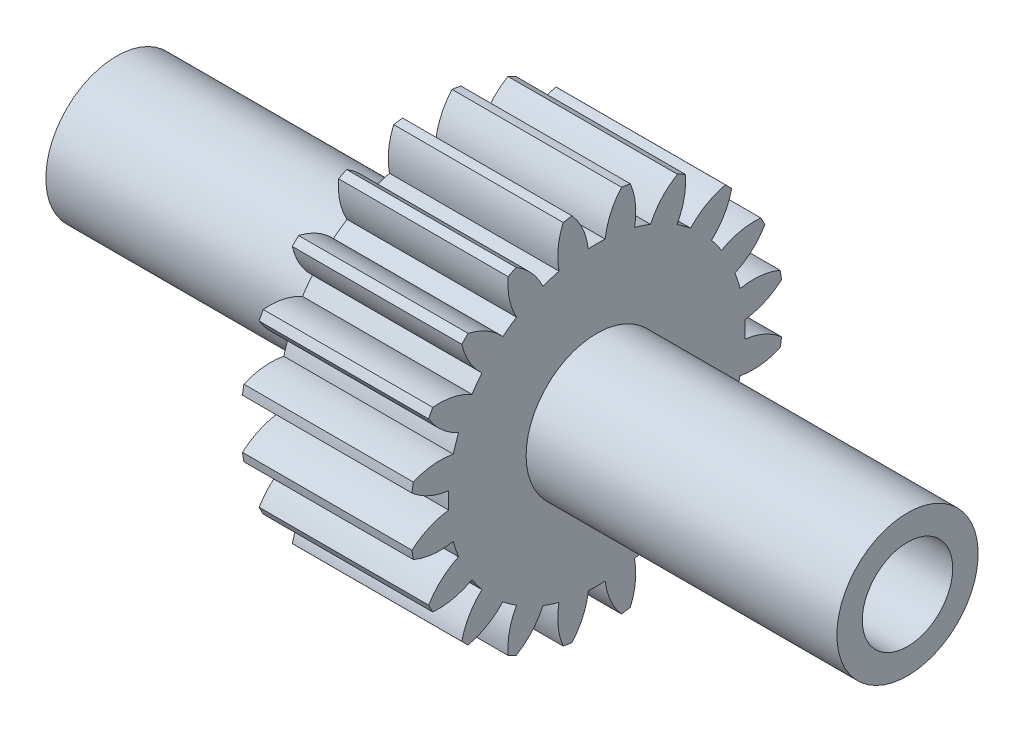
ISO-10303-21;
HEADER;
FILE_DESCRIPTION(('STEP AP214'),'2;1');
FILE_NAME('part.step','',(''),(''),'','','');
FILE_SCHEMA(('AUTOMOTIVE_DESIGN { 1 0 10303 214 1 1 1 1 }'));
ENDSEC;
DATA;
#1=APPLICATION_CONTEXT('core data for automotive mechanical design processes');
#2=APPLICATION_PROTOCOL_DEFINITION('international standard','automotive_design',2000,#1);
#3=PRODUCT_CONTEXT('',#1,'mechanical');
#4=PRODUCT('Part','Part','',(#3));
#5=PRODUCT_RELATED_PRODUCT_CATEGORY('part','',(#4));
#6=PRODUCT_DEFINITION_FORMATION('','',#4);
#7=PRODUCT_DEFINITION_CONTEXT('part definition',#1,'design');
#8=PRODUCT_DEFINITION('design','',#6,#7);
#9=PRODUCT_DEFINITION_SHAPE('','',#8);
#10=(LENGTH_UNIT() NAMED_UNIT(*) SI_UNIT(.MILLI.,.METRE.));
#11=(NAMED_UNIT(*) PLANE_ANGLE_UNIT() SI_UNIT($,.RADIAN.));
#12=(NAMED_UNIT(*) SI_UNIT($,.STERADIAN.) SOLID_ANGLE_UNIT());
#13=UNCERTAINTY_MEASURE_WITH_UNIT(LENGTH_MEASURE(1.E-05),#10,'distance_accuracy_value','');
#14=(GEOMETRIC_REPRESENTATION_CONTEXT(3) GLOBAL_UNCERTAINTY_ASSIGNED_CONTEXT((#13)) GLOBAL_UNIT_ASSIGNED_CONTEXT((#10,
#11,#12)) REPRESENTATION_CONTEXT('',''));
#15=CARTESIAN_POINT('',(0.,0.,0.));
#16=DIRECTION('',(0.,0.,1.));
#17=DIRECTION('',(1.,0.,0.));
#18=AXIS2_PLACEMENT_3D('',#15,#16,#17);
#19=CARTESIAN_POINT('',(15.,0.,0.));
#20=DIRECTION('',(-1.,0.,0.));
#21=DIRECTION('',(0.,0.,1.));
#22=AXIS2_PLACEMENT_3D('',#19,#20,#21);
#23=PLANE('',#22);
#24=CARTESIAN_POINT('',(15.,0.,0.));
#25=DIRECTION('',(-1.,0.,0.));
#26=DIRECTION('',(0.,0.,1.));
#27=AXIS2_PLACEMENT_3D('',#24,#25,#26);
#28=CIRCLE('',#27,6.25);
#29=CARTESIAN_POINT('',(15.,0.,6.25));
#30=VERTEX_POINT('',#29);
#31=EDGE_CURVE('E11',#30,#30,#28,.F.);
#32=ORIENTED_EDGE('',*,*,#31,.F.);
#33=EDGE_LOOP('',(#32));
#34=FACE_BOUND('',#33,.T.);
#35=CARTESIAN_POINT('',(15.,6.70248356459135,12.3998674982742));
#36=DIRECTION('',(-1.,0.,0.));
#37=DIRECTION('',(0.,1.,0.));
#38=AXIS2_PLACEMENT_3D('',#35,#36,#37);
#39=CIRCLE('',#38,5.999999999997);
#40=CARTESIAN_POINT('',(15.,0.743814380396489,13.1029048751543));
#41=VERTEX_POINT('',#40);
#42=CARTESIAN_POINT('',(15.,2.18978312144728,16.354046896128));
#43=VERTEX_POINT('',#42);
#44=EDGE_CURVE('E569',#41,#43,#39,.T.);
#45=ORIENTED_EDGE('',*,*,#44,.F.);
#46=CARTESIAN_POINT('',(15.,0.,0.));
#47=DIRECTION('',(-1.,0.,0.));
#48=DIRECTION('',(0.,1.,0.));
#49=AXIS2_PLACEMENT_3D('',#46,#47,#48);
#50=CIRCLE('',#49,13.1239999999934);
#51=CARTESIAN_POINT('',(15.,-0.743814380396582,13.1029048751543));
#52=VERTEX_POINT('',#51);
#53=EDGE_CURVE('E574',#52,#41,#50,.T.);
#54=ORIENTED_EDGE('',*,*,#53,.F.);
#55=CARTESIAN_POINT('',(15.,-6.70248356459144,12.3998674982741));
#56=DIRECTION('',(-1.,0.,0.));
#57=DIRECTION('',(0.,1.,0.));
#58=AXIS2_PLACEMENT_3D('',#55,#56,#57);
#59=CIRCLE('',#58,5.999999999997);
#60=CARTESIAN_POINT('',(15.,-2.1897831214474,16.3540468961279));
#61=VERTEX_POINT('',#60);
#62=EDGE_CURVE('E571',#61,#52,#59,.T.);
#63=ORIENTED_EDGE('',*,*,#62,.F.);
#64=CARTESIAN_POINT('',(15.,0.,0.));
#65=DIRECTION('',(-1.,0.,0.));
#66=DIRECTION('',(0.,0.,1.));
#67=AXIS2_PLACEMENT_3D('',#64,#65,#66);
#68=CIRCLE('',#67,16.4999999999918);
#69=CARTESIAN_POINT('',(15.,-2.97107091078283,16.2303030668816));
#70=VERTEX_POINT('',#69);
#71=EDGE_CURVE('E1134',#70,#61,#68,.T.);
#72=ORIENTED_EDGE('',*,*,#71,.F.);
#73=CARTESIAN_POINT('',(15.,2.54267088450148,13.8641561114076));
#74=DIRECTION('',(-1.,0.,0.));
#75=DIRECTION('',(0.,0.951056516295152,0.309016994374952));
#76=AXIS2_PLACEMENT_3D('',#73,#74,#75);
#77=CIRCLE('',#76,5.999999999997);
#78=CARTESIAN_POINT('',(15.,-3.34161076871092,12.691454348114));
#79=VERTEX_POINT('',#78);
#80=EDGE_CURVE('E687',#79,#70,#77,.T.);
#81=ORIENTED_EDGE('',*,*,#80,.F.);
#82=CARTESIAN_POINT('',(15.,0.,0.));
#83=DIRECTION('',(-1.,0.,0.));
#84=DIRECTION('',(0.,0.951056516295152,0.309016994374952));
#85=AXIS2_PLACEMENT_3D('',#82,#83,#84);
#86=CIRCLE('',#85,13.1239999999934);
#87=CARTESIAN_POINT('',(15.,-4.75642979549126,12.231751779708));
#88=VERTEX_POINT('',#87);
#89=EDGE_CURVE('E692',#88,#79,#86,.T.);
#90=ORIENTED_EDGE('',*,*,#89,.F.);
#91=CARTESIAN_POINT('',(15.,-10.2062104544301,9.72179345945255));
#92=DIRECTION('',(-1.,0.,0.));
#93=DIRECTION('',(0.,0.951056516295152,0.309016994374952));
#94=AXIS2_PLACEMENT_3D('',#91,#92,#93);
#95=CIRCLE('',#94,5.999999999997);
#96=CARTESIAN_POINT('',(15.,-7.13628592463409,14.8769426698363));
#97=VERTEX_POINT('',#96);
#98=EDGE_CURVE('E689',#97,#88,#95,.T.);
#99=ORIENTED_EDGE('',*,*,#98,.F.);
#100=CARTESIAN_POINT('',(15.,-7.84109582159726,14.5178240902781));
#101=VERTEX_POINT('',#100);
#102=EDGE_CURVE('E1113',#101,#97,#68,.T.);
#103=ORIENTED_EDGE('',*,*,#102,.F.);
#104=CARTESIAN_POINT('',(15.,-1.86603613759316,13.9713245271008));
#105=DIRECTION('',(-1.,0.,0.));
#106=DIRECTION('',(0.,0.809016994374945,0.587785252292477));
#107=AXIS2_PLACEMENT_3D('',#104,#105,#106);
#108=CIRCLE('',#107,5.999999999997);
#109=CARTESIAN_POINT('',(15.,-7.09993577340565,11.0376758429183));
#110=VERTEX_POINT('',#109);
#111=EDGE_CURVE('E670',#110,#101,#108,.T.);
#112=ORIENTED_EDGE('',*,*,#111,.F.);
#113=CARTESIAN_POINT('',(15.,0.,0.));
#114=DIRECTION('',(-1.,0.,0.));
#115=DIRECTION('',(0.,0.809016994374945,0.587785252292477));
#116=AXIS2_PLACEMENT_3D('',#113,#114,#115);
#117=CIRCLE('',#116,13.1239999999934);
#118=CARTESIAN_POINT('',(15.,-8.30345272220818,10.163269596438));
#119=VERTEX_POINT('',#118);
#120=EDGE_CURVE('E675',#119,#110,#117,.T.);
#121=ORIENTED_EDGE('',*,*,#120,.F.);
#122=CARTESIAN_POINT('',(15.,-12.7108823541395,6.09208254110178));
#123=DIRECTION('',(-1.,0.,0.));
#124=DIRECTION('',(0.,0.809016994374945,0.587785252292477));
#125=AXIS2_PLACEMENT_3D('',#122,#123,#124);
#126=CIRCLE('',#125,5.999999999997);
#127=CARTESIAN_POINT('',(15.,-11.3842393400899,11.9435796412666));
#128=VERTEX_POINT('',#127);
#129=EDGE_CURVE('E672',#128,#119,#126,.T.);
#130=ORIENTED_EDGE('',*,*,#129,.F.);
#131=CARTESIAN_POINT('',(15.,-11.9435796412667,11.3842393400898));
#132=VERTEX_POINT('',#131);
#133=EDGE_CURVE('E1327',#132,#128,#68,.T.);
#134=ORIENTED_EDGE('',*,*,#133,.F.);
#135=CARTESIAN_POINT('',(15.,-6.09208254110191,12.7108823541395));
#136=DIRECTION('',(-1.,0.,0.));
#137=DIRECTION('',(0.,0.587785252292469,0.809016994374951));
#138=AXIS2_PLACEMENT_3D('',#135,#136,#137);
#139=CIRCLE('',#138,5.999999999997);
#140=CARTESIAN_POINT('',(15.,-10.1632695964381,8.30345272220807));
#141=VERTEX_POINT('',#140);
#142=EDGE_CURVE('E653',#141,#132,#139,.T.);
#143=ORIENTED_EDGE('',*,*,#142,.F.);
#144=CARTESIAN_POINT('',(15.,0.,0.));
#145=DIRECTION('',(-1.,0.,0.));
#146=DIRECTION('',(0.,0.587785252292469,0.809016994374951));
#147=AXIS2_PLACEMENT_3D('',#144,#145,#146);
#148=CIRCLE('',#147,13.1239999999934);
#149=CARTESIAN_POINT('',(15.,-11.0376758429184,7.09993577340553));
#150=VERTEX_POINT('',#149);
#151=EDGE_CURVE('E658',#150,#141,#148,.T.);
#152=ORIENTED_EDGE('',*,*,#151,.F.);
#153=CARTESIAN_POINT('',(15.,-13.9713245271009,1.86603613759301));
#154=DIRECTION('',(-1.,0.,0.));
#155=DIRECTION('',(0.,0.587785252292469,0.809016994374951));
#156=AXIS2_PLACEMENT_3D('',#153,#154,#155);
#157=CIRCLE('',#156,5.999999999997);
#158=CARTESIAN_POINT('',(15.,-14.5178240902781,7.8410958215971));
#159=VERTEX_POINT('',#158);
#160=EDGE_CURVE('E655',#159,#150,#157,.T.);
#161=ORIENTED_EDGE('',*,*,#160,.F.);
#162=CARTESIAN_POINT('',(15.,-14.8769426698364,7.13628592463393));
#163=VERTEX_POINT('',#162);
#164=EDGE_CURVE('E1321',#163,#159,#68,.T.);
#165=ORIENTED_EDGE('',*,*,#164,.F.);
#166=CARTESIAN_POINT('',(15.,-9.72179345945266,10.20621045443));
#167=DIRECTION('',(-1.,0.,0.));
#168=DIRECTION('',(0.,0.309016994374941,0.951056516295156));
#169=AXIS2_PLACEMENT_3D('',#166,#167,#168);
#170=CIRCLE('',#169,5.999999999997);
#171=CARTESIAN_POINT('',(15.,-12.2317517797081,4.75642979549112));
#172=VERTEX_POINT('',#171);
#173=EDGE_CURVE('E617',#172,#163,#170,.T.);
#174=ORIENTED_EDGE('',*,*,#173,.F.);
#175=CARTESIAN_POINT('',(15.,0.,0.));
#176=DIRECTION('',(-1.,0.,0.));
#177=DIRECTION('',(0.,0.309016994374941,0.951056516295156));
#178=AXIS2_PLACEMENT_3D('',#175,#176,#177);
#179=CIRCLE('',#178,13.1239999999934);
#180=CARTESIAN_POINT('',(15.,-12.6914543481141,3.34161076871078));
#181=VERTEX_POINT('',#180);
#182=EDGE_CURVE('E622',#181,#172,#179,.T.);
#183=ORIENTED_EDGE('',*,*,#182,.F.);
#184=CARTESIAN_POINT('',(15.,-13.8641561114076,-2.54267088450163));
#185=DIRECTION('',(-1.,0.,0.));
#186=DIRECTION('',(0.,0.309016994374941,0.951056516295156));
#187=AXIS2_PLACEMENT_3D('',#184,#185,#186);
#188=CIRCLE('',#187,5.999999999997);
#189=CARTESIAN_POINT('',(15.,-16.2303030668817,2.97107091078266));
#190=VERTEX_POINT('',#189);
#191=EDGE_CURVE('E619',#190,#181,#188,.T.);
#192=ORIENTED_EDGE('',*,*,#191,.F.);
#193=CARTESIAN_POINT('',(15.,-16.354046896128,2.18978312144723));
#194=VERTEX_POINT('',#193);
#195=EDGE_CURVE('E1315',#194,#190,#68,.T.);
#196=ORIENTED_EDGE('',*,*,#195,.F.);
#197=CARTESIAN_POINT('',(15.,-12.3998674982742,6.70248356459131));
#198=DIRECTION('',(-1.,0.,0.));
#199=DIRECTION('',(0.,0.,1.));
#200=AXIS2_PLACEMENT_3D('',#197,#198,#199);
#201=CIRCLE('',#200,5.999999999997);
#202=CARTESIAN_POINT('',(15.,-13.1029048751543,0.743814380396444));
#203=VERTEX_POINT('',#202);
#204=EDGE_CURVE('E636',#203,#194,#201,.T.);
#205=ORIENTED_EDGE('',*,*,#204,.F.);
#206=CARTESIAN_POINT('',(15.,0.,0.));
#207=DIRECTION('',(-1.,0.,0.));
#208=DIRECTION('',(0.,0.,1.));
#209=AXIS2_PLACEMENT_3D('',#206,#207,#208);
#210=CIRCLE('',#209,13.1239999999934);
#211=CARTESIAN_POINT('',(15.,-13.1029048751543,-0.743814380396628));
#212=VERTEX_POINT('',#211);
#213=EDGE_CURVE('E641',#212,#203,#210,.T.);
#214=ORIENTED_EDGE('',*,*,#213,.F.);
#215=CARTESIAN_POINT('',(15.,-12.3998674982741,-6.70248356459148));
#216=DIRECTION('',(-1.,0.,0.));
#217=DIRECTION('',(0.,0.,1.));
#218=AXIS2_PLACEMENT_3D('',#215,#216,#217);
#219=CIRCLE('',#218,5.999999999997);
#220=CARTESIAN_POINT('',(15.,-16.3540468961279,-2.18978312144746));
#221=VERTEX_POINT('',#220);
#222=EDGE_CURVE('E638',#221,#212,#219,.T.);
#223=ORIENTED_EDGE('',*,*,#222,.F.);
#224=CARTESIAN_POINT('',(15.,-16.2303030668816,-2.97107091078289));
#225=VERTEX_POINT('',#224);
#226=EDGE_CURVE('E1309',#225,#221,#68,.T.);
#227=ORIENTED_EDGE('',*,*,#226,.F.);
#228=CARTESIAN_POINT('',(15.,-13.8641561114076,2.54267088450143));
#229=DIRECTION('',(-1.,0.,0.));
#230=DIRECTION('',(0.,-0.309016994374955,0.951056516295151));
#231=AXIS2_PLACEMENT_3D('',#228,#229,#230);
#232=CIRCLE('',#231,5.999999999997);
#233=CARTESIAN_POINT('',(15.,-12.691454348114,-3.34161076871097));
#234=VERTEX_POINT('',#233);
#235=EDGE_CURVE('E755',#234,#225,#232,.T.);
#236=ORIENTED_EDGE('',*,*,#235,.F.);
#237=CARTESIAN_POINT('',(15.,0.,0.));
#238=DIRECTION('',(-1.,0.,0.));
#239=DIRECTION('',(0.,-0.309016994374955,0.951056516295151));
#240=AXIS2_PLACEMENT_3D('',#237,#238,#239);
#241=CIRCLE('',#240,13.1239999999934);
#242=CARTESIAN_POINT('',(15.,-12.231751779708,-4.7564297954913));
#243=VERTEX_POINT('',#242);
#244=EDGE_CURVE('E760',#243,#234,#241,.T.);
#245=ORIENTED_EDGE('',*,*,#244,.F.);
#246=CARTESIAN_POINT('',(15.,-9.72179345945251,-10.2062104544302));
#247=DIRECTION('',(-1.,0.,0.));
#248=DIRECTION('',(0.,-0.309016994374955,0.951056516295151));
#249=AXIS2_PLACEMENT_3D('',#246,#247,#248);
#250=CIRCLE('',#249,5.999999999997);
#251=CARTESIAN_POINT('',(15.,-14.8769426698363,-7.13628592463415));
#252=VERTEX_POINT('',#251);
#253=EDGE_CURVE('E757',#252,#243,#250,.T.);
#254=ORIENTED_EDGE('',*,*,#253,.F.);
#255=CARTESIAN_POINT('',(15.,-14.517824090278,-7.84109582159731));
#256=VERTEX_POINT('',#255);
#257=EDGE_CURVE('E1303',#256,#252,#68,.T.);
#258=ORIENTED_EDGE('',*,*,#257,.F.);
#259=CARTESIAN_POINT('',(15.,-13.9713245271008,-1.86603613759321));
#260=DIRECTION('',(-1.,0.,0.));
#261=DIRECTION('',(0.,-0.58778525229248,0.809016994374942));
#262=AXIS2_PLACEMENT_3D('',#259,#260,#261);
#263=CIRCLE('',#262,5.999999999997);
#264=CARTESIAN_POINT('',(15.,-11.0376758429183,-7.09993577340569));
#265=VERTEX_POINT('',#264);
#266=EDGE_CURVE('E738',#265,#256,#263,.T.);
#267=ORIENTED_EDGE('',*,*,#266,.F.);
#268=CARTESIAN_POINT('',(15.,0.,0.));
#269=DIRECTION('',(-1.,0.,0.));
#270=DIRECTION('',(0.,-0.58778525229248,0.809016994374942));
#271=AXIS2_PLACEMENT_3D('',#268,#269,#270);
#272=CIRCLE('',#271,13.1239999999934);
#273=CARTESIAN_POINT('',(15.,-10.163269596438,-8.30345272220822));
#274=VERTEX_POINT('',#273);
#275=EDGE_CURVE('E743',#274,#265,#272,.T.);
#276=ORIENTED_EDGE('',*,*,#275,.F.);
#277=CARTESIAN_POINT('',(15.,-6.09208254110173,-12.7108823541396));
#278=DIRECTION('',(-1.,0.,0.));
#279=DIRECTION('',(0.,-0.58778525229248,0.809016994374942));
#280=AXIS2_PLACEMENT_3D('',#277,#278,#279);
#281=CIRCLE('',#280,5.999999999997);
#282=CARTESIAN_POINT('',(15.,-11.9435796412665,-11.3842393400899));
#283=VERTEX_POINT('',#282);
#284=EDGE_CURVE('E740',#283,#274,#281,.T.);
#285=ORIENTED_EDGE('',*,*,#284,.F.);
#286=CARTESIAN_POINT('',(15.,-11.3842393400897,-11.9435796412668));
#287=VERTEX_POINT('',#286);
#288=EDGE_CURVE('E1297',#287,#283,#68,.T.);
#289=ORIENTED_EDGE('',*,*,#288,.F.);
#290=CARTESIAN_POINT('',(15.,-12.7108823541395,-6.09208254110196));
#291=DIRECTION('',(-1.,0.,0.));
#292=DIRECTION('',(0.,-0.809016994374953,0.587785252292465));
#293=AXIS2_PLACEMENT_3D('',#290,#291,#292);
#294=CIRCLE('',#293,5.999999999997);
#295=CARTESIAN_POINT('',(15.,-8.30345272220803,-10.1632695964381));
#296=VERTEX_POINT('',#295);
#297=EDGE_CURVE('E721',#296,#287,#294,.T.);
#298=ORIENTED_EDGE('',*,*,#297,.F.);
#299=CARTESIAN_POINT('',(15.,0.,0.));
#300=DIRECTION('',(-1.,0.,0.));
#301=DIRECTION('',(0.,-0.809016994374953,0.587785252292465));
#302=AXIS2_PLACEMENT_3D('',#299,#300,#301);
#303=CIRCLE('',#302,13.1239999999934);
#304=CARTESIAN_POINT('',(15.,-7.09993577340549,-11.0376758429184));
#305=VERTEX_POINT('',#304);
#306=EDGE_CURVE('E726',#305,#296,#303,.T.);
#307=ORIENTED_EDGE('',*,*,#306,.F.);
#308=CARTESIAN_POINT('',(15.,-1.86603613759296,-13.9713245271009));
#309=DIRECTION('',(-1.,0.,0.));
#310=DIRECTION('',(0.,-0.809016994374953,0.587785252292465));
#311=AXIS2_PLACEMENT_3D('',#308,#309,#310);
#312=CIRCLE('',#311,5.999999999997);
#313=CARTESIAN_POINT('',(15.,-7.84109582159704,-14.5178240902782));
#314=VERTEX_POINT('',#313);
#315=EDGE_CURVE('E723',#314,#305,#312,.T.);
#316=ORIENTED_EDGE('',*,*,#315,.F.);
#317=CARTESIAN_POINT('',(15.,-7.13628592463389,-14.8769426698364));
#318=VERTEX_POINT('',#317);
#319=EDGE_CURVE('E1291',#318,#314,#68,.T.);
#320=ORIENTED_EDGE('',*,*,#319,.F.);
#321=CARTESIAN_POINT('',(15.,-10.20621045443,-9.72179345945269));
#322=DIRECTION('',(-1.,0.,0.));
#323=DIRECTION('',(0.,-0.951056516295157,0.309016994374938));
#324=AXIS2_PLACEMENT_3D('',#321,#322,#323);
#325=CIRCLE('',#324,5.999999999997);
#326=CARTESIAN_POINT('',(15.,-4.75642979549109,-12.2317517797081));
#327=VERTEX_POINT('',#326);
#328=EDGE_CURVE('E702',#327,#318,#325,.T.);
#329=ORIENTED_EDGE('',*,*,#328,.F.);
#330=CARTESIAN_POINT('',(15.,0.,0.));
#331=DIRECTION('',(-1.,0.,0.));
#332=DIRECTION('',(0.,-0.951056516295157,0.309016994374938));
#333=AXIS2_PLACEMENT_3D('',#330,#331,#332);
#334=CIRCLE('',#333,13.1239999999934);
#335=CARTESIAN_POINT('',(15.,-3.34161076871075,-12.6914543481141));
#336=VERTEX_POINT('',#335);
#337=EDGE_CURVE('E707',#336,#327,#334,.T.);
#338=ORIENTED_EDGE('',*,*,#337,.F.);
#339=CARTESIAN_POINT('',(15.,2.54267088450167,-13.8641561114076));
#340=DIRECTION('',(-1.,0.,0.));
#341=DIRECTION('',(0.,-0.951056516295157,0.309016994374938));
#342=AXIS2_PLACEMENT_3D('',#339,#340,#341);
#343=CIRCLE('',#342,5.999999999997);
#344=CARTESIAN_POINT('',(15.,-2.9710709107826,-16.2303030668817));
#345=VERTEX_POINT('',#344);
#346=EDGE_CURVE('E704',#345,#336,#343,.T.);
#347=ORIENTED_EDGE('',*,*,#346,.F.);
#348=CARTESIAN_POINT('',(15.,-2.18978312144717,-16.354046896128));
#349=VERTEX_POINT('',#348);
#350=EDGE_CURVE('E1285',#349,#345,#68,.T.);
#351=ORIENTED_EDGE('',*,*,#350,.F.);
#352=CARTESIAN_POINT('',(15.,-6.70248356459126,-12.3998674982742));
#353=DIRECTION('',(-1.,0.,0.));
#354=DIRECTION('',(0.,-1.,0.));
#355=AXIS2_PLACEMENT_3D('',#352,#353,#354);
#356=CIRCLE('',#355,5.999999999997);
#357=CARTESIAN_POINT('',(15.,-0.743814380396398,-13.1029048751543));
#358=VERTEX_POINT('',#357);
#359=EDGE_CURVE('E823',#358,#349,#356,.T.);
#360=ORIENTED_EDGE('',*,*,#359,.F.);
#361=CARTESIAN_POINT('',(15.,0.,0.));
#362=DIRECTION('',(-1.,0.,0.));
#363=DIRECTION('',(0.,-1.,0.));
#364=AXIS2_PLACEMENT_3D('',#361,#362,#363);
#365=CIRCLE('',#364,13.1239999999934);
#366=CARTESIAN_POINT('',(15.,0.743814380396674,-13.1029048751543));
#367=VERTEX_POINT('',#366);
#368=EDGE_CURVE('E828',#367,#358,#365,.T.);
#369=ORIENTED_EDGE('',*,*,#368,.F.);
#370=CARTESIAN_POINT('',(15.,6.70248356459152,-12.3998674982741));
#371=DIRECTION('',(-1.,0.,0.));
#372=DIRECTION('',(0.,-1.,0.));
#373=AXIS2_PLACEMENT_3D('',#370,#371,#372);
#374=CIRCLE('',#373,5.999999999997);
#375=CARTESIAN_POINT('',(15.,2.18978312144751,-16.3540468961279));
#376=VERTEX_POINT('',#375);
#377=EDGE_CURVE('E825',#376,#367,#374,.T.);
#378=ORIENTED_EDGE('',*,*,#377,.F.);
#379=CARTESIAN_POINT('',(15.,2.97107091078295,-16.2303030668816));
#380=VERTEX_POINT('',#379);
#381=EDGE_CURVE('E1279',#380,#376,#68,.T.);
#382=ORIENTED_EDGE('',*,*,#381,.F.);
#383=CARTESIAN_POINT('',(15.,-2.54267088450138,-13.8641561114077));
#384=DIRECTION('',(-1.,0.,0.));
#385=DIRECTION('',(0.,-0.95105651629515,-0.309016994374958));
#386=AXIS2_PLACEMENT_3D('',#383,#384,#385);
#387=CIRCLE('',#386,5.999999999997);
#388=CARTESIAN_POINT('',(15.,3.34161076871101,-12.691454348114));
#389=VERTEX_POINT('',#388);
#390=EDGE_CURVE('E840',#389,#380,#387,.T.);
#391=ORIENTED_EDGE('',*,*,#390,.F.);
#392=CARTESIAN_POINT('',(15.,0.,0.));
#393=DIRECTION('',(-1.,0.,0.));
#394=DIRECTION('',(0.,-0.95105651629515,-0.309016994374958));
#395=AXIS2_PLACEMENT_3D('',#392,#393,#394);
#396=CIRCLE('',#395,13.1239999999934);
#397=CARTESIAN_POINT('',(15.,4.75642979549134,-12.231751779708));
#398=VERTEX_POINT('',#397);
#399=EDGE_CURVE('E845',#398,#389,#396,.T.);
#400=ORIENTED_EDGE('',*,*,#399,.F.);
#401=CARTESIAN_POINT('',(15.,10.2062104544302,-9.72179345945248));
#402=DIRECTION('',(-1.,0.,0.));
#403=DIRECTION('',(0.,-0.95105651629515,-0.309016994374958));
#404=AXIS2_PLACEMENT_3D('',#401,#402,#403);
#405=CIRCLE('',#404,5.999999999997);
#406=CARTESIAN_POINT('',(15.,7.1362859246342,-14.8769426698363));
#407=VERTEX_POINT('',#406);
#408=EDGE_CURVE('E842',#407,#398,#405,.T.);
#409=ORIENTED_EDGE('',*,*,#408,.F.);
#410=CARTESIAN_POINT('',(15.,7.84109582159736,-14.517824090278));
#411=VERTEX_POINT('',#410);
#412=EDGE_CURVE('E1273',#411,#407,#68,.T.);
#413=ORIENTED_EDGE('',*,*,#412,.F.);
#414=CARTESIAN_POINT('',(15.,1.86603613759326,-13.9713245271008));
#415=DIRECTION('',(-1.,0.,0.));
#416=DIRECTION('',(0.,-0.80901699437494,-0.587785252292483));
#417=AXIS2_PLACEMENT_3D('',#414,#415,#416);
#418=CIRCLE('',#417,5.999999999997);
#419=CARTESIAN_POINT('',(15.,7.09993577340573,-11.0376758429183));
#420=VERTEX_POINT('',#419);
#421=EDGE_CURVE('E806',#420,#411,#418,.T.);
#422=ORIENTED_EDGE('',*,*,#421,.F.);
#423=CARTESIAN_POINT('',(15.,0.,0.));
#424=DIRECTION('',(-1.,0.,0.));
#425=DIRECTION('',(0.,-0.80901699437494,-0.587785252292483));
#426=AXIS2_PLACEMENT_3D('',#423,#424,#425);
#427=CIRCLE('',#426,13.1239999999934);
#428=CARTESIAN_POINT('',(15.,8.30345272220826,-10.1632695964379));
#429=VERTEX_POINT('',#428);
#430=EDGE_CURVE('E811',#429,#420,#427,.T.);
#431=ORIENTED_EDGE('',*,*,#430,.F.);
#432=CARTESIAN_POINT('',(15.,12.7108823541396,-6.09208254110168));
#433=DIRECTION('',(-1.,0.,0.));
#434=DIRECTION('',(0.,-0.80901699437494,-0.587785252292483));
#435=AXIS2_PLACEMENT_3D('',#432,#433,#434);
#436=CIRCLE('',#435,5.999999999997);
#437=CARTESIAN_POINT('',(15.,11.38423934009,-11.9435796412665));
#438=VERTEX_POINT('',#437);
#439=EDGE_CURVE('E808',#438,#429,#436,.T.);
#440=ORIENTED_EDGE('',*,*,#439,.F.);
#441=CARTESIAN_POINT('',(15.,11.9435796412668,-11.3842393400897));
#442=VERTEX_POINT('',#441);
#443=EDGE_CURVE('E1267',#442,#438,#68,.T.);
#444=ORIENTED_EDGE('',*,*,#443,.F.);
#445=CARTESIAN_POINT('',(15.,6.092082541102,-12.7108823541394));
#446=DIRECTION('',(-1.,0.,0.));
#447=DIRECTION('',(0.,-0.587785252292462,-0.809016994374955));
#448=AXIS2_PLACEMENT_3D('',#445,#446,#447);
#449=CIRCLE('',#448,5.999999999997);
#450=CARTESIAN_POINT('',(15.,10.1632695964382,-8.303452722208));
#451=VERTEX_POINT('',#450);
#452=EDGE_CURVE('E789',#451,#442,#449,.T.);
#453=ORIENTED_EDGE('',*,*,#452,.F.);
#454=CARTESIAN_POINT('',(15.,0.,0.));
#455=DIRECTION('',(-1.,0.,0.));
#456=DIRECTION('',(0.,-0.587785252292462,-0.809016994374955));
#457=AXIS2_PLACEMENT_3D('',#454,#455,#456);
#458=CIRCLE('',#457,13.1239999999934);
#459=CARTESIAN_POINT('',(15.,11.0376758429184,-7.09993577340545));
#460=VERTEX_POINT('',#459);
#461=EDGE_CURVE('E794',#460,#451,#458,.T.);
#462=ORIENTED_EDGE('',*,*,#461,.F.);
#463=CARTESIAN_POINT('',(15.,13.9713245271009,-1.86603613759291));
#464=DIRECTION('',(-1.,0.,0.));
#465=DIRECTION('',(0.,-0.587785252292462,-0.809016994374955));
#466=AXIS2_PLACEMENT_3D('',#463,#464,#465);
#467=CIRCLE('',#466,5.999999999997);
#468=CARTESIAN_POINT('',(15.,14.5178240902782,-7.84109582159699));
#469=VERTEX_POINT('',#468);
#470=EDGE_CURVE('E791',#469,#460,#467,.T.);
#471=ORIENTED_EDGE('',*,*,#470,.F.);
#472=CARTESIAN_POINT('',(15.,14.8769426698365,-7.13628592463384));
#473=VERTEX_POINT('',#472);
#474=EDGE_CURVE('E980',#473,#469,#68,.T.);
#475=ORIENTED_EDGE('',*,*,#474,.F.);
#476=CARTESIAN_POINT('',(15.,9.72179345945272,-10.20621045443));
#477=DIRECTION('',(-1.,0.,0.));
#478=DIRECTION('',(0.,-0.309016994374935,-0.951056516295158));
#479=AXIS2_PLACEMENT_3D('',#476,#477,#478);
#480=CIRCLE('',#479,5.999999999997);
#481=CARTESIAN_POINT('',(15.,12.2317517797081,-4.75642979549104));
#482=VERTEX_POINT('',#481);
#483=EDGE_CURVE('E770',#482,#473,#480,.T.);
#484=ORIENTED_EDGE('',*,*,#483,.F.);
#485=CARTESIAN_POINT('',(15.,0.,0.));
#486=DIRECTION('',(-1.,0.,0.));
#487=DIRECTION('',(0.,-0.309016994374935,-0.951056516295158));
#488=AXIS2_PLACEMENT_3D('',#485,#486,#487);
#489=CIRCLE('',#488,13.1239999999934);
#490=CARTESIAN_POINT('',(15.,12.6914543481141,-3.3416107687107));
#491=VERTEX_POINT('',#490);
#492=EDGE_CURVE('E775',#491,#482,#489,.T.);
#493=ORIENTED_EDGE('',*,*,#492,.F.);
#494=CARTESIAN_POINT('',(15.,13.8641561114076,2.54267088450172));
#495=DIRECTION('',(-1.,0.,0.));
#496=DIRECTION('',(0.,-0.309016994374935,-0.951056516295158));
#497=AXIS2_PLACEMENT_3D('',#494,#495,#496);
#498=CIRCLE('',#497,5.999999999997);
#499=CARTESIAN_POINT('',(15.,16.2303030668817,-2.97107091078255));
#500=VERTEX_POINT('',#499);
#501=EDGE_CURVE('E772',#500,#491,#498,.T.);
#502=ORIENTED_EDGE('',*,*,#501,.F.);
#503=CARTESIAN_POINT('',(15.,16.3540468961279,-2.18978312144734));
#504=VERTEX_POINT('',#503);
#505=EDGE_CURVE('E976',#504,#500,#68,.T.);
#506=ORIENTED_EDGE('',*,*,#505,.F.);
#507=CARTESIAN_POINT('',(15.,12.3998674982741,-6.70248356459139));
#508=DIRECTION('',(-1.,0.,0.));
#509=DIRECTION('',(0.,0.,-1.));
#510=AXIS2_PLACEMENT_3D('',#507,#508,#509);
#511=CIRCLE('',#510,5.999999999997);
#512=CARTESIAN_POINT('',(15.,13.1029048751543,-0.743814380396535));
#513=VERTEX_POINT('',#512);
#514=EDGE_CURVE('E948',#513,#504,#511,.T.);
#515=ORIENTED_EDGE('',*,*,#514,.F.);
#516=CARTESIAN_POINT('',(15.,0.,0.));
#517=DIRECTION('',(-1.,0.,0.));
#518=DIRECTION('',(0.,0.,-1.));
#519=AXIS2_PLACEMENT_3D('',#516,#517,#518);
#520=CIRCLE('',#519,13.1239999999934);
#521=CARTESIAN_POINT('',(15.,13.1029048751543,0.743814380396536));
#522=VERTEX_POINT('',#521);
#523=EDGE_CURVE('E953',#522,#513,#520,.T.);
#524=ORIENTED_EDGE('',*,*,#523,.F.);
#525=CARTESIAN_POINT('',(15.,12.3998674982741,6.70248356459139));
#526=DIRECTION('',(-1.,0.,0.));
#527=DIRECTION('',(0.,0.,-1.));
#528=AXIS2_PLACEMENT_3D('',#525,#526,#527);
#529=CIRCLE('',#528,5.999999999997);
#530=CARTESIAN_POINT('',(15.,16.3540468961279,2.18978312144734));
#531=VERTEX_POINT('',#530);
#532=EDGE_CURVE('E950',#531,#522,#529,.T.);
#533=ORIENTED_EDGE('',*,*,#532,.F.);
#534=CARTESIAN_POINT('',(15.,16.2303030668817,2.97107091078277));
#535=VERTEX_POINT('',#534);
#536=EDGE_CURVE('E973',#535,#531,#68,.T.);
#537=ORIENTED_EDGE('',*,*,#536,.F.);
#538=CARTESIAN_POINT('',(15.,13.8641561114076,-2.54267088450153));
#539=DIRECTION('',(-1.,0.,0.));
#540=DIRECTION('',(0.,0.309016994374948,-0.951056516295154));
#541=AXIS2_PLACEMENT_3D('',#538,#539,#540);
#542=CIRCLE('',#541,5.999999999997);
#543=CARTESIAN_POINT('',(15.,12.6914543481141,3.34161076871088));
#544=VERTEX_POINT('',#543);
#545=EDGE_CURVE('E926',#544,#535,#542,.T.);
#546=ORIENTED_EDGE('',*,*,#545,.F.);
#547=CARTESIAN_POINT('',(15.,0.,0.));
#548=DIRECTION('',(-1.,0.,0.));
#549=DIRECTION('',(0.,0.309016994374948,-0.951056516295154));
#550=AXIS2_PLACEMENT_3D('',#547,#548,#549);
#551=CIRCLE('',#550,13.1239999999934);
#552=CARTESIAN_POINT('',(15.,12.2317517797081,4.75642979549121));
#553=VERTEX_POINT('',#552);
#554=EDGE_CURVE('E931',#553,#544,#551,.T.);
#555=ORIENTED_EDGE('',*,*,#554,.F.);
#556=CARTESIAN_POINT('',(15.,9.72179345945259,10.2062104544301));
#557=DIRECTION('',(-1.,0.,0.));
#558=DIRECTION('',(0.,0.309016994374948,-0.951056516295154));
#559=AXIS2_PLACEMENT_3D('',#556,#557,#558);
#560=CIRCLE('',#559,5.999999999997);
#561=CARTESIAN_POINT('',(15.,14.8769426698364,7.13628592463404));
#562=VERTEX_POINT('',#561);
#563=EDGE_CURVE('E928',#562,#553,#560,.T.);
#564=ORIENTED_EDGE('',*,*,#563,.F.);
#565=CARTESIAN_POINT('',(15.,14.5178240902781,7.8410958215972));
#566=VERTEX_POINT('',#565);
#567=EDGE_CURVE('E981',#566,#562,#68,.T.);
#568=ORIENTED_EDGE('',*,*,#567,.F.);
#569=CARTESIAN_POINT('',(15.,13.9713245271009,1.86603613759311));
#570=DIRECTION('',(-1.,0.,0.));
#571=DIRECTION('',(0.,0.587785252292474,-0.809016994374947));
#572=AXIS2_PLACEMENT_3D('',#569,#570,#571);
#573=CIRCLE('',#572,5.999999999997);
#574=CARTESIAN_POINT('',(15.,11.0376758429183,7.09993577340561));
#575=VERTEX_POINT('',#574);
#576=EDGE_CURVE('E600',#575,#566,#573,.T.);
#577=ORIENTED_EDGE('',*,*,#576,.F.);
#578=CARTESIAN_POINT('',(15.,0.,0.));
#579=DIRECTION('',(-1.,0.,0.));
#580=DIRECTION('',(0.,0.587785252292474,-0.809016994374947));
#581=AXIS2_PLACEMENT_3D('',#578,#579,#580);
#582=CIRCLE('',#581,13.1239999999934);
#583=CARTESIAN_POINT('',(15.,10.163269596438,8.30345272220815));
#584=VERTEX_POINT('',#583);
#585=EDGE_CURVE('E605',#584,#575,#582,.T.);
#586=ORIENTED_EDGE('',*,*,#585,.F.);
#587=CARTESIAN_POINT('',(15.,6.09208254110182,12.7108823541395));
#588=DIRECTION('',(-1.,0.,0.));
#589=DIRECTION('',(0.,0.587785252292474,-0.809016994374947));
#590=AXIS2_PLACEMENT_3D('',#587,#588,#589);
#591=CIRCLE('',#590,5.999999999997);
#592=CARTESIAN_POINT('',(15.,11.9435796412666,11.3842393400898));
#593=VERTEX_POINT('',#592);
#594=EDGE_CURVE('E602',#593,#584,#591,.T.);
#595=ORIENTED_EDGE('',*,*,#594,.F.);
#596=CARTESIAN_POINT('',(15.,11.3842393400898,11.9435796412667));
#597=VERTEX_POINT('',#596);
#598=EDGE_CURVE('E1252',#597,#593,#68,.T.);
#599=ORIENTED_EDGE('',*,*,#598,.F.);
#600=CARTESIAN_POINT('',(15.,12.7108823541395,6.09208254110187));
#601=DIRECTION('',(-1.,0.,0.));
#602=DIRECTION('',(0.,0.809016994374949,-0.587785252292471));
#603=AXIS2_PLACEMENT_3D('',#600,#601,#602);
#604=CIRCLE('',#603,5.999999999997);
#605=CARTESIAN_POINT('',(15.,8.30345272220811,10.1632695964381));
#606=VERTEX_POINT('',#605);
#607=EDGE_CURVE('E583',#606,#597,#604,.T.);
#608=ORIENTED_EDGE('',*,*,#607,.F.);
#609=CARTESIAN_POINT('',(15.,0.,0.));
#610=DIRECTION('',(-1.,0.,0.));
#611=DIRECTION('',(0.,0.809016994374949,-0.587785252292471));
#612=AXIS2_PLACEMENT_3D('',#609,#610,#611);
#613=CIRCLE('',#612,13.1239999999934);
#614=CARTESIAN_POINT('',(15.,7.09993577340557,11.0376758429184));
#615=VERTEX_POINT('',#614);
#616=EDGE_CURVE('E588',#615,#606,#613,.T.);
#617=ORIENTED_EDGE('',*,*,#616,.F.);
#618=CARTESIAN_POINT('',(15.,1.86603613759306,13.9713245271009));
#619=DIRECTION('',(-1.,0.,0.));
#620=DIRECTION('',(0.,0.809016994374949,-0.587785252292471));
#621=AXIS2_PLACEMENT_3D('',#618,#619,#620);
#622=CIRCLE('',#621,5.999999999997);
#623=CARTESIAN_POINT('',(15.,7.84109582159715,14.5178240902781));
#624=VERTEX_POINT('',#623);
#625=EDGE_CURVE('E585',#624,#615,#622,.T.);
#626=ORIENTED_EDGE('',*,*,#625,.F.);
#627=CARTESIAN_POINT('',(15.,7.13628592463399,14.8769426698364));
#628=VERTEX_POINT('',#627);
#629=EDGE_CURVE('E1248',#628,#624,#68,.T.);
#630=ORIENTED_EDGE('',*,*,#629,.F.);
#631=CARTESIAN_POINT('',(15.,10.2062104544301,9.72179345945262));
#632=DIRECTION('',(-1.,0.,0.));
#633=DIRECTION('',(0.,0.951056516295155,-0.309016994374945));
#634=AXIS2_PLACEMENT_3D('',#631,#632,#633);
#635=CIRCLE('',#634,5.999999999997);
#636=CARTESIAN_POINT('',(15.,4.75642979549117,12.2317517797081));
#637=VERTEX_POINT('',#636);
#638=EDGE_CURVE('E549',#637,#628,#635,.T.);
#639=ORIENTED_EDGE('',*,*,#638,.F.);
#640=CARTESIAN_POINT('',(15.,0.,0.));
#641=DIRECTION('',(-1.,0.,0.));
#642=DIRECTION('',(0.,0.951056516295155,-0.309016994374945));
#643=AXIS2_PLACEMENT_3D('',#640,#641,#642);
#644=CIRCLE('',#643,13.1239999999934);
#645=CARTESIAN_POINT('',(15.,3.34161076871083,12.6914543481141));
#646=VERTEX_POINT('',#645);
#647=EDGE_CURVE('E548',#646,#637,#644,.T.);
#648=ORIENTED_EDGE('',*,*,#647,.F.);
#649=CARTESIAN_POINT('',(15.,-2.54267088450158,13.8641561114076));
#650=DIRECTION('',(-1.,0.,0.));
#651=DIRECTION('',(0.,0.951056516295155,-0.309016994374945));
#652=AXIS2_PLACEMENT_3D('',#649,#650,#651);
#653=CIRCLE('',#652,5.999999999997);
#654=CARTESIAN_POINT('',(15.,2.97107091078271,16.2303030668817));
#655=VERTEX_POINT('',#654);
#656=EDGE_CURVE('E537',#655,#646,#653,.T.);
#657=ORIENTED_EDGE('',*,*,#656,.F.);
#658=EDGE_CURVE('E1251',#43,#655,#68,.T.);
#659=ORIENTED_EDGE('',*,*,#658,.F.);
#660=EDGE_LOOP('',(#45,#54,#63,#72,#81,#90,#99,#103,#112,#121,#130,#134,#143,#152,#161,#165,
#174,#183,#192,#196,#205,#214,#223,#227,#236,#245,#254,#258,#267,#276,#285,#289,#298,#307,#316,
#320,#329,#338,#347,#351,#360,#369,#378,#382,#391,#400,#409,#413,#422,#431,#440,#444,#453,#462,
#471,#475,#484,#493,#502,#506,#515,#524,#533,#537,#546,#555,#564,#568,#577,#586,#595,#599,#608,
#617,#626,#630,#639,#648,#657,#659));
#661=FACE_BOUND('',#660,.T.);
#662=ADVANCED_FACE('F39',(#34,#661),#23,.F.);
#663=CARTESIAN_POINT('',(-10.,0.,0.));
#664=DIRECTION('',(-1.,0.,0.));
#665=DIRECTION('',(0.,0.,1.));
#666=AXIS2_PLACEMENT_3D('',#663,#664,#665);
#667=CYLINDRICAL_SURFACE('',#666,16.4999999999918);
#668=DIRECTION('',(-1.,0.,0.));
#669=VECTOR('',#668,1.);
#670=CARTESIAN_POINT('',(7.5,2.18978312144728,16.354046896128));
#671=LINE('',#670,#669);
#672=CARTESIAN_POINT('',(0.,2.18978312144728,16.354046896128));
#673=VERTEX_POINT('',#672);
#674=EDGE_CURVE('E923',#43,#673,#671,.T.);
#675=ORIENTED_EDGE('',*,*,#674,.F.);
#676=ORIENTED_EDGE('',*,*,#658,.T.);
#677=DIRECTION('',(-1.,0.,0.));
#678=VECTOR('',#677,1.);
#679=CARTESIAN_POINT('',(7.5,2.97107091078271,16.2303030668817));
#680=LINE('',#679,#678);
#681=CARTESIAN_POINT('',(0.,2.97107091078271,16.2303030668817));
#682=VERTEX_POINT('',#681);
#683=EDGE_CURVE('E543',#682,#655,#680,.F.);
#684=ORIENTED_EDGE('',*,*,#683,.F.);
#685=CARTESIAN_POINT('',(0.,0.,0.));
#686=DIRECTION('',(-1.,0.,0.));
#687=DIRECTION('',(0.,0.,1.));
#688=AXIS2_PLACEMENT_3D('',#685,#686,#687);
#689=CIRCLE('',#688,16.4999999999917);
#690=EDGE_CURVE('E1036',#673,#682,#689,.T.);
#691=ORIENTED_EDGE('',*,*,#690,.F.);
#692=EDGE_LOOP('',(#675,#676,#684,#691));
#693=FACE_BOUND('',#692,.T.);
#694=ADVANCED_FACE('F1041',(#693),#667,.T.);
#695=DIRECTION('',(-1.,0.,0.));
#696=VECTOR('',#695,1.);
#697=CARTESIAN_POINT('',(7.5,-2.18978312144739,16.3540468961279));
#698=LINE('',#697,#696);
#699=CARTESIAN_POINT('',(0.,-2.18978312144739,16.3540468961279));
#700=VERTEX_POINT('',#699);
#701=EDGE_CURVE('E921',#700,#61,#698,.F.);
#702=ORIENTED_EDGE('',*,*,#701,.F.);
#703=CARTESIAN_POINT('',(0.,-2.97107091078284,16.2303030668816));
#704=VERTEX_POINT('',#703);
#705=EDGE_CURVE('E1042',#704,#700,#689,.T.);
#706=ORIENTED_EDGE('',*,*,#705,.F.);
#707=DIRECTION('',(-1.,0.,0.));
#708=VECTOR('',#707,1.);
#709=CARTESIAN_POINT('',(7.5,-2.97107091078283,16.2303030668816));
#710=LINE('',#709,#708);
#711=EDGE_CURVE('E896',#70,#704,#710,.T.);
#712=ORIENTED_EDGE('',*,*,#711,.F.);
#713=ORIENTED_EDGE('',*,*,#71,.T.);
#714=EDGE_LOOP('',(#702,#706,#712,#713));
#715=FACE_BOUND('',#714,.T.);
#716=ADVANCED_FACE('F1132',(#715),#667,.T.);
#717=DIRECTION('',(-1.,0.,0.));
#718=VECTOR('',#717,1.);
#719=CARTESIAN_POINT('',(7.5,7.13628592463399,14.8769426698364));
#720=LINE('',#719,#718);
#721=CARTESIAN_POINT('',(0.,7.13628592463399,14.8769426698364));
#722=VERTEX_POINT('',#721);
#723=EDGE_CURVE('E919',#628,#722,#720,.T.);
#724=ORIENTED_EDGE('',*,*,#723,.F.);
#725=ORIENTED_EDGE('',*,*,#629,.T.);
#726=DIRECTION('',(-1.,0.,0.));
#727=VECTOR('',#726,1.);
#728=CARTESIAN_POINT('',(7.5,7.84109582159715,14.5178240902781));
#729=LINE('',#728,#727);
#730=CARTESIAN_POINT('',(0.,7.84109582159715,14.5178240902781));
#731=VERTEX_POINT('',#730);
#732=EDGE_CURVE('E910',#731,#624,#729,.F.);
#733=ORIENTED_EDGE('',*,*,#732,.F.);
#734=EDGE_CURVE('E1043',#722,#731,#689,.T.);
#735=ORIENTED_EDGE('',*,*,#734,.F.);
#736=EDGE_LOOP('',(#724,#725,#733,#735));
#737=FACE_BOUND('',#736,.T.);
#738=ADVANCED_FACE('F1246',(#737),#667,.T.);
#739=DIRECTION('',(-1.,0.,0.));
#740=VECTOR('',#739,1.);
#741=CARTESIAN_POINT('',(7.5,14.5178240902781,7.8410958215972));
#742=LINE('',#741,#740);
#743=CARTESIAN_POINT('',(0.,14.5178240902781,7.8410958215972));
#744=VERTEX_POINT('',#743);
#745=EDGE_CURVE('E916',#566,#744,#742,.T.);
#746=ORIENTED_EDGE('',*,*,#745,.F.);
#747=ORIENTED_EDGE('',*,*,#567,.T.);
#748=DIRECTION('',(-1.,0.,0.));
#749=VECTOR('',#748,1.);
#750=CARTESIAN_POINT('',(7.5,14.8769426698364,7.13628592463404));
#751=LINE('',#750,#749);
#752=CARTESIAN_POINT('',(0.,14.8769426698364,7.13628592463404));
#753=VERTEX_POINT('',#752);
#754=EDGE_CURVE('E942',#753,#562,#751,.F.);
#755=ORIENTED_EDGE('',*,*,#754,.F.);
#756=EDGE_CURVE('E975',#744,#753,#689,.T.);
#757=ORIENTED_EDGE('',*,*,#756,.F.);
#758=EDGE_LOOP('',(#746,#747,#755,#757));
#759=FACE_BOUND('',#758,.T.);
#760=ADVANCED_FACE('F1760',(#759),#667,.T.);
#761=DIRECTION('',(-1.,0.,0.));
#762=VECTOR('',#761,1.);
#763=CARTESIAN_POINT('',(7.5,11.9435796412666,11.3842393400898));
#764=LINE('',#763,#762);
#765=CARTESIAN_POINT('',(0.,11.9435796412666,11.3842393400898));
#766=VERTEX_POINT('',#765);
#767=EDGE_CURVE('E914',#766,#593,#764,.F.);
#768=ORIENTED_EDGE('',*,*,#767,.F.);
#769=CARTESIAN_POINT('',(0.,11.3842393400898,11.9435796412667));
#770=VERTEX_POINT('',#769);
#771=EDGE_CURVE('E1047',#770,#766,#689,.T.);
#772=ORIENTED_EDGE('',*,*,#771,.F.);
#773=DIRECTION('',(-1.,0.,0.));
#774=VECTOR('',#773,1.);
#775=CARTESIAN_POINT('',(7.5,11.3842393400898,11.9435796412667));
#776=LINE('',#775,#774);
#777=EDGE_CURVE('E912',#597,#770,#776,.T.);
#778=ORIENTED_EDGE('',*,*,#777,.F.);
#779=ORIENTED_EDGE('',*,*,#598,.T.);
#780=EDGE_LOOP('',(#768,#772,#778,#779));
#781=FACE_BOUND('',#780,.T.);
#782=ADVANCED_FACE('F1757',(#781),#667,.T.);
#783=DIRECTION('',(-1.,0.,0.));
#784=VECTOR('',#783,1.);
#785=CARTESIAN_POINT('',(7.5,-11.9435796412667,11.3842393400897));
#786=LINE('',#785,#784);
#787=CARTESIAN_POINT('',(0.,-11.9435796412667,11.3842393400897));
#788=VERTEX_POINT('',#787);
#789=EDGE_CURVE('E908',#132,#788,#786,.T.);
#790=ORIENTED_EDGE('',*,*,#789,.F.);
#791=ORIENTED_EDGE('',*,*,#133,.T.);
#792=DIRECTION('',(-1.,0.,0.));
#793=VECTOR('',#792,1.);
#794=CARTESIAN_POINT('',(7.5,-11.3842393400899,11.9435796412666));
#795=LINE('',#794,#793);
#796=CARTESIAN_POINT('',(0.,-11.3842393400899,11.9435796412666));
#797=VERTEX_POINT('',#796);
#798=EDGE_CURVE('E890',#797,#128,#795,.F.);
#799=ORIENTED_EDGE('',*,*,#798,.F.);
#800=EDGE_CURVE('E1098',#788,#797,#689,.T.);
#801=ORIENTED_EDGE('',*,*,#800,.F.);
#802=EDGE_LOOP('',(#790,#791,#799,#801));
#803=FACE_BOUND('',#802,.T.);
#804=ADVANCED_FACE('F1337',(#803),#667,.T.);
#805=DIRECTION('',(-1.,0.,0.));
#806=VECTOR('',#805,1.);
#807=CARTESIAN_POINT('',(7.5,-14.5178240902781,7.8410958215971));
#808=LINE('',#807,#806);
#809=CARTESIAN_POINT('',(0.,-14.5178240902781,7.8410958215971));
#810=VERTEX_POINT('',#809);
#811=EDGE_CURVE('E906',#810,#159,#808,.F.);
#812=ORIENTED_EDGE('',*,*,#811,.F.);
#813=CARTESIAN_POINT('',(0.,-14.8769426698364,7.13628592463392));
#814=VERTEX_POINT('',#813);
#815=EDGE_CURVE('E1094',#814,#810,#689,.T.);
#816=ORIENTED_EDGE('',*,*,#815,.F.);
#817=DIRECTION('',(-1.,0.,0.));
#818=VECTOR('',#817,1.);
#819=CARTESIAN_POINT('',(7.5,-14.8769426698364,7.13628592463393));
#820=LINE('',#819,#818);
#821=EDGE_CURVE('E904',#163,#814,#820,.T.);
#822=ORIENTED_EDGE('',*,*,#821,.F.);
#823=ORIENTED_EDGE('',*,*,#164,.T.);
#824=EDGE_LOOP('',(#812,#816,#822,#823));
#825=FACE_BOUND('',#824,.T.);
#826=ADVANCED_FACE('F1566',(#825),#667,.T.);
#827=DIRECTION('',(-1.,0.,0.));
#828=VECTOR('',#827,1.);
#829=CARTESIAN_POINT('',(7.5,-16.2303030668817,2.97107091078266));
#830=LINE('',#829,#828);
#831=CARTESIAN_POINT('',(0.,-16.2303030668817,2.97107091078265));
#832=VERTEX_POINT('',#831);
#833=EDGE_CURVE('E902',#832,#190,#830,.F.);
#834=ORIENTED_EDGE('',*,*,#833,.F.);
#835=CARTESIAN_POINT('',(0.,-16.354046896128,2.18978312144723));
#836=VERTEX_POINT('',#835);
#837=EDGE_CURVE('E1090',#836,#832,#689,.T.);
#838=ORIENTED_EDGE('',*,*,#837,.F.);
#839=DIRECTION('',(-1.,0.,0.));
#840=VECTOR('',#839,1.);
#841=CARTESIAN_POINT('',(7.5,-16.354046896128,2.18978312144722));
#842=LINE('',#841,#840);
#843=EDGE_CURVE('E900',#194,#836,#842,.T.);
#844=ORIENTED_EDGE('',*,*,#843,.F.);
#845=ORIENTED_EDGE('',*,*,#195,.T.);
#846=EDGE_LOOP('',(#834,#838,#844,#845));
#847=FACE_BOUND('',#846,.T.);
#848=ADVANCED_FACE('F1553',(#847),#667,.T.);
#849=DIRECTION('',(-1.,0.,0.));
#850=VECTOR('',#849,1.);
#851=CARTESIAN_POINT('',(7.5,-16.3540468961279,-2.18978312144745));
#852=LINE('',#851,#850);
#853=CARTESIAN_POINT('',(0.,-16.3540468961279,-2.18978312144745));
#854=VERTEX_POINT('',#853);
#855=EDGE_CURVE('E898',#854,#221,#852,.F.);
#856=ORIENTED_EDGE('',*,*,#855,.F.);
#857=CARTESIAN_POINT('',(0.,-16.2303030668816,-2.97107091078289));
#858=VERTEX_POINT('',#857);
#859=EDGE_CURVE('E1086',#858,#854,#689,.T.);
#860=ORIENTED_EDGE('',*,*,#859,.F.);
#861=DIRECTION('',(-1.,0.,0.));
#862=VECTOR('',#861,1.);
#863=CARTESIAN_POINT('',(7.5,-16.2303030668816,-2.97107091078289));
#864=LINE('',#863,#862);
#865=EDGE_CURVE('E880',#225,#858,#864,.T.);
#866=ORIENTED_EDGE('',*,*,#865,.F.);
#867=ORIENTED_EDGE('',*,*,#226,.T.);
#868=EDGE_LOOP('',(#856,#860,#866,#867));
#869=FACE_BOUND('',#868,.T.);
#870=ADVANCED_FACE('F1541',(#869),#667,.T.);
#871=DIRECTION('',(-1.,0.,0.));
#872=VECTOR('',#871,1.);
#873=CARTESIAN_POINT('',(7.5,-7.13628592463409,14.8769426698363));
#874=LINE('',#873,#872);
#875=CARTESIAN_POINT('',(0.,-7.13628592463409,14.8769426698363));
#876=VERTEX_POINT('',#875);
#877=EDGE_CURVE('E894',#876,#97,#874,.F.);
#878=ORIENTED_EDGE('',*,*,#877,.F.);
#879=CARTESIAN_POINT('',(0.,-7.84109582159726,14.5178240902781));
#880=VERTEX_POINT('',#879);
#881=EDGE_CURVE('E1045',#880,#876,#689,.T.);
#882=ORIENTED_EDGE('',*,*,#881,.F.);
#883=DIRECTION('',(-1.,0.,0.));
#884=VECTOR('',#883,1.);
#885=CARTESIAN_POINT('',(7.5,-7.84109582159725,14.5178240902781));
#886=LINE('',#885,#884);
#887=EDGE_CURVE('E892',#101,#880,#886,.T.);
#888=ORIENTED_EDGE('',*,*,#887,.F.);
#889=ORIENTED_EDGE('',*,*,#102,.T.);
#890=EDGE_LOOP('',(#878,#882,#888,#889));
#891=FACE_BOUND('',#890,.T.);
#892=ADVANCED_FACE('F1110',(#891),#667,.T.);
#893=DIRECTION('',(-1.,0.,0.));
#894=VECTOR('',#893,1.);
#895=CARTESIAN_POINT('',(7.5,-11.3842393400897,-11.9435796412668));
#896=LINE('',#895,#894);
#897=CARTESIAN_POINT('',(0.,-11.3842393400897,-11.9435796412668));
#898=VERTEX_POINT('',#897);
#899=EDGE_CURVE('E888',#287,#898,#896,.T.);
#900=ORIENTED_EDGE('',*,*,#899,.F.);
#901=ORIENTED_EDGE('',*,*,#288,.T.);
#902=DIRECTION('',(-1.,0.,0.));
#903=VECTOR('',#902,1.);
#904=CARTESIAN_POINT('',(7.5,-11.9435796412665,-11.3842393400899));
#905=LINE('',#904,#903);
#906=CARTESIAN_POINT('',(0.,-11.9435796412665,-11.3842393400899));
#907=VERTEX_POINT('',#906);
#908=EDGE_CURVE('E874',#907,#283,#905,.F.);
#909=ORIENTED_EDGE('',*,*,#908,.F.);
#910=EDGE_CURVE('E1078',#898,#907,#689,.T.);
#911=ORIENTED_EDGE('',*,*,#910,.F.);
#912=EDGE_LOOP('',(#900,#901,#909,#911));
#913=FACE_BOUND('',#912,.T.);
#914=ADVANCED_FACE('F1527',(#913),#667,.T.);
#915=DIRECTION('',(-1.,0.,0.));
#916=VECTOR('',#915,1.);
#917=CARTESIAN_POINT('',(7.5,-7.84109582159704,-14.5178240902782));
#918=LINE('',#917,#916);
#919=CARTESIAN_POINT('',(0.,-7.84109582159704,-14.5178240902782));
#920=VERTEX_POINT('',#919);
#921=EDGE_CURVE('E886',#920,#314,#918,.F.);
#922=ORIENTED_EDGE('',*,*,#921,.F.);
#923=CARTESIAN_POINT('',(0.,-7.13628592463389,-14.8769426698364));
#924=VERTEX_POINT('',#923);
#925=EDGE_CURVE('E1074',#924,#920,#689,.T.);
#926=ORIENTED_EDGE('',*,*,#925,.F.);
#927=DIRECTION('',(-1.,0.,0.));
#928=VECTOR('',#927,1.);
#929=CARTESIAN_POINT('',(7.5,-7.13628592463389,-14.8769426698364));
#930=LINE('',#929,#928);
#931=EDGE_CURVE('E884',#318,#924,#930,.T.);
#932=ORIENTED_EDGE('',*,*,#931,.F.);
#933=ORIENTED_EDGE('',*,*,#319,.T.);
#934=EDGE_LOOP('',(#922,#926,#932,#933));
#935=FACE_BOUND('',#934,.T.);
#936=ADVANCED_FACE('F1520',(#935),#667,.T.);
#937=DIRECTION('',(-1.,0.,0.));
#938=VECTOR('',#937,1.);
#939=CARTESIAN_POINT('',(7.5,-2.97107091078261,-16.2303030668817));
#940=LINE('',#939,#938);
#941=CARTESIAN_POINT('',(0.,-2.97107091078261,-16.2303030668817));
#942=VERTEX_POINT('',#941);
#943=EDGE_CURVE('E882',#942,#345,#940,.F.);
#944=ORIENTED_EDGE('',*,*,#943,.F.);
#945=CARTESIAN_POINT('',(0.,-2.18978312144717,-16.354046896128));
#946=VERTEX_POINT('',#945);
#947=EDGE_CURVE('E1070',#946,#942,#689,.T.);
#948=ORIENTED_EDGE('',*,*,#947,.F.);
#949=DIRECTION('',(-1.,0.,0.));
#950=VECTOR('',#949,1.);
#951=CARTESIAN_POINT('',(7.5,-2.18978312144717,-16.354046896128));
#952=LINE('',#951,#950);
#953=EDGE_CURVE('E856',#349,#946,#952,.T.);
#954=ORIENTED_EDGE('',*,*,#953,.F.);
#955=ORIENTED_EDGE('',*,*,#350,.T.);
#956=EDGE_LOOP('',(#944,#948,#954,#955));
#957=FACE_BOUND('',#956,.T.);
#958=ADVANCED_FACE('F1513',(#957),#667,.T.);
#959=DIRECTION('',(-1.,0.,0.));
#960=VECTOR('',#959,1.);
#961=CARTESIAN_POINT('',(7.5,-14.8769426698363,-7.13628592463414));
#962=LINE('',#961,#960);
#963=CARTESIAN_POINT('',(0.,-14.8769426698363,-7.13628592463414));
#964=VERTEX_POINT('',#963);
#965=EDGE_CURVE('E878',#964,#252,#962,.F.);
#966=ORIENTED_EDGE('',*,*,#965,.F.);
#967=CARTESIAN_POINT('',(0.,-14.517824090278,-7.84109582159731));
#968=VERTEX_POINT('',#967);
#969=EDGE_CURVE('E1082',#968,#964,#689,.T.);
#970=ORIENTED_EDGE('',*,*,#969,.F.);
#971=DIRECTION('',(-1.,0.,0.));
#972=VECTOR('',#971,1.);
#973=CARTESIAN_POINT('',(7.5,-14.517824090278,-7.84109582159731));
#974=LINE('',#973,#972);
#975=EDGE_CURVE('E876',#256,#968,#974,.T.);
#976=ORIENTED_EDGE('',*,*,#975,.F.);
#977=ORIENTED_EDGE('',*,*,#257,.T.);
#978=EDGE_LOOP('',(#966,#970,#976,#977));
#979=FACE_BOUND('',#978,.T.);
#980=ADVANCED_FACE('F1534',(#979),#667,.T.);
#981=DIRECTION('',(-1.,0.,0.));
#982=VECTOR('',#981,1.);
#983=CARTESIAN_POINT('',(7.5,7.84109582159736,-14.517824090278));
#984=LINE('',#983,#982);
#985=CARTESIAN_POINT('',(0.,7.84109582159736,-14.517824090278));
#986=VERTEX_POINT('',#985);
#987=EDGE_CURVE('E872',#411,#986,#984,.T.);
#988=ORIENTED_EDGE('',*,*,#987,.F.);
#989=ORIENTED_EDGE('',*,*,#412,.T.);
#990=DIRECTION('',(-1.,0.,0.));
#991=VECTOR('',#990,1.);
#992=CARTESIAN_POINT('',(7.5,7.1362859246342,-14.8769426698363));
#993=LINE('',#992,#991);
#994=CARTESIAN_POINT('',(0.,7.1362859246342,-14.8769426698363));
#995=VERTEX_POINT('',#994);
#996=EDGE_CURVE('E858',#995,#407,#993,.F.);
#997=ORIENTED_EDGE('',*,*,#996,.F.);
#998=EDGE_CURVE('E1062',#986,#995,#689,.T.);
#999=ORIENTED_EDGE('',*,*,#998,.F.);
#1000=EDGE_LOOP('',(#988,#989,#997,#999));
#1001=FACE_BOUND('',#1000,.T.);
#1002=ADVANCED_FACE('F1797',(#1001),#667,.T.);
#1003=DIRECTION('',(-1.,0.,0.));
#1004=VECTOR('',#1003,1.);
#1005=CARTESIAN_POINT('',(7.5,11.38423934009,-11.9435796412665));
#1006=LINE('',#1005,#1004);
#1007=CARTESIAN_POINT('',(0.,11.38423934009,-11.9435796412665));
#1008=VERTEX_POINT('',#1007);
#1009=EDGE_CURVE('E870',#1008,#438,#1006,.F.);
#1010=ORIENTED_EDGE('',*,*,#1009,.F.);
#1011=CARTESIAN_POINT('',(0.,11.9435796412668,-11.3842393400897));
#1012=VERTEX_POINT('',#1011);
#1013=EDGE_CURVE('E1058',#1012,#1008,#689,.T.);
#1014=ORIENTED_EDGE('',*,*,#1013,.F.);
#1015=DIRECTION('',(-1.,0.,0.));
#1016=VECTOR('',#1015,1.);
#1017=CARTESIAN_POINT('',(7.5,11.9435796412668,-11.3842393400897));
#1018=LINE('',#1017,#1016);
#1019=EDGE_CURVE('E864',#442,#1012,#1018,.T.);
#1020=ORIENTED_EDGE('',*,*,#1019,.F.);
#1021=ORIENTED_EDGE('',*,*,#443,.T.);
#1022=EDGE_LOOP('',(#1010,#1014,#1020,#1021));
#1023=FACE_BOUND('',#1022,.T.);
#1024=ADVANCED_FACE('F1790',(#1023),#667,.T.);
#1025=DIRECTION('',(-1.,0.,0.));
#1026=VECTOR('',#1025,1.);
#1027=CARTESIAN_POINT('',(7.5,14.8769426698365,-7.13628592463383));
#1028=LINE('',#1027,#1026);
#1029=CARTESIAN_POINT('',(0.,14.8769426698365,-7.13628592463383));
#1030=VERTEX_POINT('',#1029);
#1031=EDGE_CURVE('E868',#473,#1030,#1028,.T.);
#1032=ORIENTED_EDGE('',*,*,#1031,.F.);
#1033=ORIENTED_EDGE('',*,*,#474,.T.);
#1034=DIRECTION('',(-1.,0.,0.));
#1035=VECTOR('',#1034,1.);
#1036=CARTESIAN_POINT('',(7.5,14.5178240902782,-7.84109582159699));
#1037=LINE('',#1036,#1035);
#1038=CARTESIAN_POINT('',(0.,14.5178240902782,-7.84109582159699));
#1039=VERTEX_POINT('',#1038);
#1040=EDGE_CURVE('E862',#1039,#469,#1037,.F.);
#1041=ORIENTED_EDGE('',*,*,#1040,.F.);
#1042=EDGE_CURVE('E974',#1030,#1039,#689,.T.);
#1043=ORIENTED_EDGE('',*,*,#1042,.F.);
#1044=EDGE_LOOP('',(#1032,#1033,#1041,#1043));
#1045=FACE_BOUND('',#1044,.T.);
#1046=ADVANCED_FACE('F1503',(#1045),#667,.T.);
#1047=DIRECTION('',(-1.,0.,0.));
#1048=VECTOR('',#1047,1.);
#1049=CARTESIAN_POINT('',(7.5,16.2303030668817,-2.97107091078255));
#1050=LINE('',#1049,#1048);
#1051=CARTESIAN_POINT('',(0.,16.2303030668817,-2.97107091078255));
#1052=VERTEX_POINT('',#1051);
#1053=EDGE_CURVE('E866',#1052,#500,#1050,.F.);
#1054=ORIENTED_EDGE('',*,*,#1053,.F.);
#1055=CARTESIAN_POINT('',(0.,16.3540468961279,-2.18978312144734));
#1056=VERTEX_POINT('',#1055);
#1057=EDGE_CURVE('E970',#1056,#1052,#689,.T.);
#1058=ORIENTED_EDGE('',*,*,#1057,.F.);
#1059=DIRECTION('',(-1.,0.,0.));
#1060=VECTOR('',#1059,1.);
#1061=CARTESIAN_POINT('',(7.5,16.3540468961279,-2.18978312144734));
#1062=LINE('',#1061,#1060);
#1063=EDGE_CURVE('E967',#504,#1056,#1062,.T.);
#1064=ORIENTED_EDGE('',*,*,#1063,.F.);
#1065=ORIENTED_EDGE('',*,*,#505,.T.);
#1066=EDGE_LOOP('',(#1054,#1058,#1064,#1065));
#1067=FACE_BOUND('',#1066,.T.);
#1068=ADVANCED_FACE('F1500',(#1067),#667,.T.);
#1069=DIRECTION('',(-1.,0.,0.));
#1070=VECTOR('',#1069,1.);
#1071=CARTESIAN_POINT('',(7.5,2.97107091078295,-16.2303030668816));
#1072=LINE('',#1071,#1070);
#1073=CARTESIAN_POINT('',(0.,2.97107091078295,-16.2303030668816));
#1074=VERTEX_POINT('',#1073);
#1075=EDGE_CURVE('E860',#380,#1074,#1072,.T.);
#1076=ORIENTED_EDGE('',*,*,#1075,.F.);
#1077=ORIENTED_EDGE('',*,*,#381,.T.);
#1078=DIRECTION('',(-1.,0.,0.));
#1079=VECTOR('',#1078,1.);
#1080=CARTESIAN_POINT('',(7.5,2.18978312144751,-16.3540468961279));
#1081=LINE('',#1080,#1079);
#1082=CARTESIAN_POINT('',(0.,2.18978312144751,-16.3540468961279));
#1083=VERTEX_POINT('',#1082);
#1084=EDGE_CURVE('E616',#1083,#376,#1081,.F.);
#1085=ORIENTED_EDGE('',*,*,#1084,.F.);
#1086=EDGE_CURVE('E1066',#1074,#1083,#689,.T.);
#1087=ORIENTED_EDGE('',*,*,#1086,.F.);
#1088=EDGE_LOOP('',(#1076,#1077,#1085,#1087));
#1089=FACE_BOUND('',#1088,.T.);
#1090=ADVANCED_FACE('F1032',(#1089),#667,.T.);
#1091=CARTESIAN_POINT('',(0.,0.,0.));
#1092=DIRECTION('',(1.,0.,0.));
#1093=DIRECTION('',(0.,0.,-1.));
#1094=AXIS2_PLACEMENT_3D('',#1091,#1092,#1093);
#1095=PLANE('',#1094);
#1096=CARTESIAN_POINT('',(0.,0.,0.));
#1097=DIRECTION('',(1.,0.,0.));
#1098=DIRECTION('',(0.,0.,-1.));
#1099=AXIS2_PLACEMENT_3D('',#1096,#1097,#1098);
#1100=CIRCLE('',#1099,6.25);
#1101=CARTESIAN_POINT('',(0.,0.,-6.25));
#1102=VERTEX_POINT('',#1101);
#1103=EDGE_CURVE('E47',#1102,#1102,#1100,.F.);
#1104=ORIENTED_EDGE('',*,*,#1103,.F.);
#1105=EDGE_LOOP('',(#1104));
#1106=FACE_BOUND('',#1105,.T.);
#1107=CARTESIAN_POINT('',(0.,6.70248356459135,12.3998674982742));
#1108=DIRECTION('',(-1.,0.,0.));
#1109=DIRECTION('',(0.,1.,0.));
#1110=AXIS2_PLACEMENT_3D('',#1107,#1108,#1109);
#1111=CIRCLE('',#1110,5.999999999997);
#1112=CARTESIAN_POINT('',(0.,0.743814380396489,13.1029048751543));
#1113=VERTEX_POINT('',#1112);
#1114=EDGE_CURVE('E54',#1113,#673,#1111,.T.);
#1115=ORIENTED_EDGE('',*,*,#1114,.T.);
#1116=ORIENTED_EDGE('',*,*,#690,.T.);
#1117=CARTESIAN_POINT('',(0.,-2.54267088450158,13.8641561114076));
#1118=DIRECTION('',(1.,0.,0.));
#1119=DIRECTION('',(0.,0.,-1.));
#1120=AXIS2_PLACEMENT_3D('',#1117,#1118,#1119);
#1121=CIRCLE('',#1120,5.999999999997);
#1122=CARTESIAN_POINT('',(0.,3.34161076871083,12.6914543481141));
#1123=VERTEX_POINT('',#1122);
#1124=EDGE_CURVE('E1019',#1123,#682,#1121,.T.);
#1125=ORIENTED_EDGE('',*,*,#1124,.F.);
#1126=CARTESIAN_POINT('',(0.,0.,0.));
#1127=DIRECTION('',(-1.,0.,0.));
#1128=DIRECTION('',(0.,0.951056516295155,-0.309016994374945));
#1129=AXIS2_PLACEMENT_3D('',#1126,#1127,#1128);
#1130=CIRCLE('',#1129,13.1239999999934);
#1131=CARTESIAN_POINT('',(0.,4.75642979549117,12.2317517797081));
#1132=VERTEX_POINT('',#1131);
#1133=EDGE_CURVE('E554',#1123,#1132,#1130,.T.);
#1134=ORIENTED_EDGE('',*,*,#1133,.T.);
#1135=CARTESIAN_POINT('',(0.,10.2062104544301,9.72179345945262));
#1136=DIRECTION('',(-1.,0.,0.));
#1137=DIRECTION('',(0.,0.951056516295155,-0.309016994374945));
#1138=AXIS2_PLACEMENT_3D('',#1135,#1136,#1137);
#1139=CIRCLE('',#1138,5.999999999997);
#1140=EDGE_CURVE('E62',#1132,#722,#1139,.T.);
#1141=ORIENTED_EDGE('',*,*,#1140,.T.);
#1142=ORIENTED_EDGE('',*,*,#734,.T.);
#1143=CARTESIAN_POINT('',(0.,1.86603613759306,13.9713245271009));
#1144=DIRECTION('',(1.,0.,0.));
#1145=DIRECTION('',(0.,0.,-1.));
#1146=AXIS2_PLACEMENT_3D('',#1143,#1144,#1145);
#1147=CIRCLE('',#1146,5.999999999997);
#1148=CARTESIAN_POINT('',(0.,7.09993577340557,11.0376758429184));
#1149=VERTEX_POINT('',#1148);
#1150=EDGE_CURVE('E1015',#1149,#731,#1147,.T.);
#1151=ORIENTED_EDGE('',*,*,#1150,.F.);
#1152=CARTESIAN_POINT('',(0.,0.,0.));
#1153=DIRECTION('',(-1.,0.,0.));
#1154=DIRECTION('',(0.,0.809016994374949,-0.587785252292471));
#1155=AXIS2_PLACEMENT_3D('',#1152,#1153,#1154);
#1156=CIRCLE('',#1155,13.1239999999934);
#1157=CARTESIAN_POINT('',(0.,8.30345272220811,10.1632695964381));
#1158=VERTEX_POINT('',#1157);
#1159=EDGE_CURVE('E586',#1149,#1158,#1156,.T.);
#1160=ORIENTED_EDGE('',*,*,#1159,.T.);
#1161=CARTESIAN_POINT('',(0.,12.7108823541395,6.09208254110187));
#1162=DIRECTION('',(-1.,0.,0.));
#1163=DIRECTION('',(0.,0.809016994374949,-0.587785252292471));
#1164=AXIS2_PLACEMENT_3D('',#1161,#1162,#1163);
#1165=CIRCLE('',#1164,5.999999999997);
#1166=EDGE_CURVE('E556',#1158,#770,#1165,.T.);
#1167=ORIENTED_EDGE('',*,*,#1166,.T.);
#1168=ORIENTED_EDGE('',*,*,#771,.T.);
#1169=CARTESIAN_POINT('',(0.,6.09208254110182,12.7108823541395));
#1170=DIRECTION('',(1.,0.,0.));
#1171=DIRECTION('',(0.,0.,-1.));
#1172=AXIS2_PLACEMENT_3D('',#1169,#1170,#1171);
#1173=CIRCLE('',#1172,5.999999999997);
#1174=CARTESIAN_POINT('',(0.,10.163269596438,8.30345272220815));
#1175=VERTEX_POINT('',#1174);
#1176=EDGE_CURVE('E1017',#1175,#766,#1173,.T.);
#1177=ORIENTED_EDGE('',*,*,#1176,.F.);
#1178=CARTESIAN_POINT('',(0.,0.,0.));
#1179=DIRECTION('',(-1.,0.,0.));
#1180=DIRECTION('',(0.,0.587785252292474,-0.809016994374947));
#1181=AXIS2_PLACEMENT_3D('',#1178,#1179,#1180);
#1182=CIRCLE('',#1181,13.1239999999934);
#1183=CARTESIAN_POINT('',(0.,11.0376758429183,7.09993577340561));
#1184=VERTEX_POINT('',#1183);
#1185=EDGE_CURVE('E603',#1175,#1184,#1182,.T.);
#1186=ORIENTED_EDGE('',*,*,#1185,.T.);
#1187=CARTESIAN_POINT('',(0.,13.9713245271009,1.86603613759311));
#1188=DIRECTION('',(-1.,0.,0.));
#1189=DIRECTION('',(0.,0.587785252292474,-0.809016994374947));
#1190=AXIS2_PLACEMENT_3D('',#1187,#1188,#1189);
#1191=CIRCLE('',#1190,5.999999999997);
#1192=EDGE_CURVE('E599',#1184,#744,#1191,.T.);
#1193=ORIENTED_EDGE('',*,*,#1192,.T.);
#1194=ORIENTED_EDGE('',*,*,#756,.T.);
#1195=CARTESIAN_POINT('',(0.,9.72179345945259,10.2062104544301));
#1196=DIRECTION('',(1.,0.,0.));
#1197=DIRECTION('',(0.,0.,-1.));
#1198=AXIS2_PLACEMENT_3D('',#1195,#1196,#1197);
#1199=CIRCLE('',#1198,5.999999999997);
#1200=CARTESIAN_POINT('',(0.,12.2317517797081,4.75642979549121));
#1201=VERTEX_POINT('',#1200);
#1202=EDGE_CURVE('E984',#1201,#753,#1199,.T.);
#1203=ORIENTED_EDGE('',*,*,#1202,.F.);
#1204=CARTESIAN_POINT('',(0.,0.,0.));
#1205=DIRECTION('',(-1.,0.,0.));
#1206=DIRECTION('',(0.,0.309016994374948,-0.951056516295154));
#1207=AXIS2_PLACEMENT_3D('',#1204,#1205,#1206);
#1208=CIRCLE('',#1207,13.1239999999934);
#1209=CARTESIAN_POINT('',(0.,12.6914543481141,3.34161076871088));
#1210=VERTEX_POINT('',#1209);
#1211=EDGE_CURVE('E929',#1201,#1210,#1208,.T.);
#1212=ORIENTED_EDGE('',*,*,#1211,.T.);
#1213=CARTESIAN_POINT('',(0.,13.8641561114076,-2.54267088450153));
#1214=DIRECTION('',(-1.,0.,0.));
#1215=DIRECTION('',(0.,0.309016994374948,-0.951056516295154));
#1216=AXIS2_PLACEMENT_3D('',#1213,#1214,#1215);
#1217=CIRCLE('',#1216,5.999999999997);
#1218=CARTESIAN_POINT('',(0.,16.2303030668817,2.97107091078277));
#1219=VERTEX_POINT('',#1218);
#1220=EDGE_CURVE('E925',#1210,#1219,#1217,.T.);
#1221=ORIENTED_EDGE('',*,*,#1220,.T.);
#1222=CARTESIAN_POINT('',(0.,16.3540468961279,2.18978312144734));
#1223=VERTEX_POINT('',#1222);
#1224=EDGE_CURVE('E969',#1219,#1223,#689,.T.);
#1225=ORIENTED_EDGE('',*,*,#1224,.T.);
#1226=CARTESIAN_POINT('',(0.,12.3998674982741,6.70248356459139));
#1227=DIRECTION('',(1.,0.,0.));
#1228=DIRECTION('',(0.,0.,-1.));
#1229=AXIS2_PLACEMENT_3D('',#1226,#1227,#1228);
#1230=CIRCLE('',#1229,5.999999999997);
#1231=CARTESIAN_POINT('',(0.,13.1029048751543,0.743814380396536));
#1232=VERTEX_POINT('',#1231);
#1233=EDGE_CURVE('E979',#1232,#1223,#1230,.T.);
#1234=ORIENTED_EDGE('',*,*,#1233,.F.);
#1235=CARTESIAN_POINT('',(0.,0.,0.));
#1236=DIRECTION('',(-1.,0.,0.));
#1237=DIRECTION('',(0.,0.,-1.));
#1238=AXIS2_PLACEMENT_3D('',#1235,#1236,#1237);
#1239=CIRCLE('',#1238,13.1239999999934);
#1240=CARTESIAN_POINT('',(0.,13.1029048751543,-0.743814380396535));
#1241=VERTEX_POINT('',#1240);
#1242=EDGE_CURVE('E951',#1232,#1241,#1239,.T.);
#1243=ORIENTED_EDGE('',*,*,#1242,.T.);
#1244=CARTESIAN_POINT('',(0.,12.3998674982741,-6.70248356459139));
#1245=DIRECTION('',(-1.,0.,0.));
#1246=DIRECTION('',(0.,0.,-1.));
#1247=AXIS2_PLACEMENT_3D('',#1244,#1245,#1246);
#1248=CIRCLE('',#1247,5.999999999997);
#1249=EDGE_CURVE('E947',#1241,#1056,#1248,.T.);
#1250=ORIENTED_EDGE('',*,*,#1249,.T.);
#1251=ORIENTED_EDGE('',*,*,#1057,.T.);
#1252=CARTESIAN_POINT('',(0.,13.8641561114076,2.54267088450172));
#1253=DIRECTION('',(1.,0.,0.));
#1254=DIRECTION('',(0.,0.,-1.));
#1255=AXIS2_PLACEMENT_3D('',#1252,#1253,#1254);
#1256=CIRCLE('',#1255,5.999999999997);
#1257=CARTESIAN_POINT('',(0.,12.6914543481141,-3.3416107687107));
#1258=VERTEX_POINT('',#1257);
#1259=EDGE_CURVE('E993',#1258,#1052,#1256,.T.);
#1260=ORIENTED_EDGE('',*,*,#1259,.F.);
#1261=CARTESIAN_POINT('',(0.,0.,0.));
#1262=DIRECTION('',(-1.,0.,0.));
#1263=DIRECTION('',(0.,-0.309016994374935,-0.951056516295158));
#1264=AXIS2_PLACEMENT_3D('',#1261,#1262,#1263);
#1265=CIRCLE('',#1264,13.1239999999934);
#1266=CARTESIAN_POINT('',(0.,12.2317517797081,-4.75642979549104));
#1267=VERTEX_POINT('',#1266);
#1268=EDGE_CURVE('E773',#1258,#1267,#1265,.T.);
#1269=ORIENTED_EDGE('',*,*,#1268,.T.);
#1270=CARTESIAN_POINT('',(0.,9.72179345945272,-10.20621045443));
#1271=DIRECTION('',(-1.,0.,0.));
#1272=DIRECTION('',(0.,-0.309016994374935,-0.951056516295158));
#1273=AXIS2_PLACEMENT_3D('',#1270,#1271,#1272);
#1274=CIRCLE('',#1273,5.999999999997);
#1275=EDGE_CURVE('E778',#1267,#1030,#1274,.T.);
#1276=ORIENTED_EDGE('',*,*,#1275,.T.);
#1277=ORIENTED_EDGE('',*,*,#1042,.T.);
#1278=CARTESIAN_POINT('',(0.,13.9713245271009,-1.86603613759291));
#1279=DIRECTION('',(1.,0.,0.));
#1280=DIRECTION('',(0.,0.,-1.));
#1281=AXIS2_PLACEMENT_3D('',#1278,#1279,#1280);
#1282=CIRCLE('',#1281,5.999999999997);
#1283=CARTESIAN_POINT('',(0.,11.0376758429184,-7.09993577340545));
#1284=VERTEX_POINT('',#1283);
#1285=EDGE_CURVE('E991',#1284,#1039,#1282,.T.);
#1286=ORIENTED_EDGE('',*,*,#1285,.F.);
#1287=CARTESIAN_POINT('',(0.,0.,0.));
#1288=DIRECTION('',(-1.,0.,0.));
#1289=DIRECTION('',(0.,-0.587785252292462,-0.809016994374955));
#1290=AXIS2_PLACEMENT_3D('',#1287,#1288,#1289);
#1291=CIRCLE('',#1290,13.1239999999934);
#1292=CARTESIAN_POINT('',(0.,10.1632695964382,-8.303452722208));
#1293=VERTEX_POINT('',#1292);
#1294=EDGE_CURVE('E792',#1284,#1293,#1291,.T.);
#1295=ORIENTED_EDGE('',*,*,#1294,.T.);
#1296=CARTESIAN_POINT('',(0.,6.092082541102,-12.7108823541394));
#1297=DIRECTION('',(-1.,0.,0.));
#1298=DIRECTION('',(0.,-0.587785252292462,-0.809016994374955));
#1299=AXIS2_PLACEMENT_3D('',#1296,#1297,#1298);
#1300=CIRCLE('',#1299,5.999999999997);
#1301=EDGE_CURVE('E788',#1293,#1012,#1300,.T.);
#1302=ORIENTED_EDGE('',*,*,#1301,.T.);
#1303=ORIENTED_EDGE('',*,*,#1013,.T.);
#1304=CARTESIAN_POINT('',(0.,12.7108823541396,-6.09208254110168));
#1305=DIRECTION('',(1.,0.,0.));
#1306=DIRECTION('',(0.,0.,-1.));
#1307=AXIS2_PLACEMENT_3D('',#1304,#1305,#1306);
#1308=CIRCLE('',#1307,5.999999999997);
#1309=CARTESIAN_POINT('',(0.,8.30345272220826,-10.1632695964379));
#1310=VERTEX_POINT('',#1309);
#1311=EDGE_CURVE('E995',#1310,#1008,#1308,.T.);
#1312=ORIENTED_EDGE('',*,*,#1311,.F.);
#1313=CARTESIAN_POINT('',(0.,0.,0.));
#1314=DIRECTION('',(-1.,0.,0.));
#1315=DIRECTION('',(0.,-0.80901699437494,-0.587785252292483));
#1316=AXIS2_PLACEMENT_3D('',#1313,#1314,#1315);
#1317=CIRCLE('',#1316,13.1239999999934);
#1318=CARTESIAN_POINT('',(0.,7.09993577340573,-11.0376758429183));
#1319=VERTEX_POINT('',#1318);
#1320=EDGE_CURVE('E809',#1310,#1319,#1317,.T.);
#1321=ORIENTED_EDGE('',*,*,#1320,.T.);
#1322=CARTESIAN_POINT('',(0.,1.86603613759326,-13.9713245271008));
#1323=DIRECTION('',(-1.,0.,0.));
#1324=DIRECTION('',(0.,-0.80901699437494,-0.587785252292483));
#1325=AXIS2_PLACEMENT_3D('',#1322,#1323,#1324);
#1326=CIRCLE('',#1325,5.999999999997);
#1327=EDGE_CURVE('E805',#1319,#986,#1326,.T.);
#1328=ORIENTED_EDGE('',*,*,#1327,.T.);
#1329=ORIENTED_EDGE('',*,*,#998,.T.);
#1330=CARTESIAN_POINT('',(0.,10.2062104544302,-9.72179345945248));
#1331=DIRECTION('',(1.,0.,0.));
#1332=DIRECTION('',(0.,0.,-1.));
#1333=AXIS2_PLACEMENT_3D('',#1330,#1331,#1332);
#1334=CIRCLE('',#1333,5.999999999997);
#1335=CARTESIAN_POINT('',(0.,4.75642979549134,-12.231751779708));
#1336=VERTEX_POINT('',#1335);
#1337=EDGE_CURVE('E989',#1336,#995,#1334,.T.);
#1338=ORIENTED_EDGE('',*,*,#1337,.F.);
#1339=CARTESIAN_POINT('',(0.,0.,0.));
#1340=DIRECTION('',(-1.,0.,0.));
#1341=DIRECTION('',(0.,-0.95105651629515,-0.309016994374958));
#1342=AXIS2_PLACEMENT_3D('',#1339,#1340,#1341);
#1343=CIRCLE('',#1342,13.1239999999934);
#1344=CARTESIAN_POINT('',(0.,3.34161076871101,-12.691454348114));
#1345=VERTEX_POINT('',#1344);
#1346=EDGE_CURVE('E843',#1336,#1345,#1343,.T.);
#1347=ORIENTED_EDGE('',*,*,#1346,.T.);
#1348=CARTESIAN_POINT('',(0.,-2.54267088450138,-13.8641561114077));
#1349=DIRECTION('',(-1.,0.,0.));
#1350=DIRECTION('',(0.,-0.95105651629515,-0.309016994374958));
#1351=AXIS2_PLACEMENT_3D('',#1348,#1349,#1350);
#1352=CIRCLE('',#1351,5.999999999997);
#1353=EDGE_CURVE('E822',#1345,#1074,#1352,.T.);
#1354=ORIENTED_EDGE('',*,*,#1353,.T.);
#1355=ORIENTED_EDGE('',*,*,#1086,.T.);
#1356=CARTESIAN_POINT('',(0.,6.70248356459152,-12.3998674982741));
#1357=DIRECTION('',(1.,0.,0.));
#1358=DIRECTION('',(0.,0.,-1.));
#1359=AXIS2_PLACEMENT_3D('',#1356,#1357,#1358);
#1360=CIRCLE('',#1359,5.999999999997);
#1361=CARTESIAN_POINT('',(0.,0.743814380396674,-13.1029048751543));
#1362=VERTEX_POINT('',#1361);
#1363=EDGE_CURVE('E987',#1362,#1083,#1360,.T.);
#1364=ORIENTED_EDGE('',*,*,#1363,.F.);
#1365=CARTESIAN_POINT('',(0.,0.,0.));
#1366=DIRECTION('',(-1.,0.,0.));
#1367=DIRECTION('',(0.,-1.,0.));
#1368=AXIS2_PLACEMENT_3D('',#1365,#1366,#1367);
#1369=CIRCLE('',#1368,13.1239999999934);
#1370=CARTESIAN_POINT('',(0.,-0.743814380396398,-13.1029048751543));
#1371=VERTEX_POINT('',#1370);
#1372=EDGE_CURVE('E826',#1362,#1371,#1369,.T.);
#1373=ORIENTED_EDGE('',*,*,#1372,.T.);
#1374=CARTESIAN_POINT('',(0.,-6.70248356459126,-12.3998674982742));
#1375=DIRECTION('',(-1.,0.,0.));
#1376=DIRECTION('',(0.,-1.,0.));
#1377=AXIS2_PLACEMENT_3D('',#1374,#1375,#1376);
#1378=CIRCLE('',#1377,5.999999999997);
#1379=EDGE_CURVE('E831',#1371,#946,#1378,.T.);
#1380=ORIENTED_EDGE('',*,*,#1379,.T.);
#1381=ORIENTED_EDGE('',*,*,#947,.T.);
#1382=CARTESIAN_POINT('',(0.,2.54267088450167,-13.8641561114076));
#1383=DIRECTION('',(1.,0.,0.));
#1384=DIRECTION('',(0.,0.,-1.));
#1385=AXIS2_PLACEMENT_3D('',#1382,#1383,#1384);
#1386=CIRCLE('',#1385,5.999999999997);
#1387=CARTESIAN_POINT('',(0.,-3.34161076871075,-12.6914543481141));
#1388=VERTEX_POINT('',#1387);
#1389=EDGE_CURVE('E1001',#1388,#942,#1386,.T.);
#1390=ORIENTED_EDGE('',*,*,#1389,.F.);
#1391=CARTESIAN_POINT('',(0.,0.,0.));
#1392=DIRECTION('',(-1.,0.,0.));
#1393=DIRECTION('',(0.,-0.951056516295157,0.309016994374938));
#1394=AXIS2_PLACEMENT_3D('',#1391,#1392,#1393);
#1395=CIRCLE('',#1394,13.1239999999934);
#1396=CARTESIAN_POINT('',(0.,-4.75642979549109,-12.2317517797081));
#1397=VERTEX_POINT('',#1396);
#1398=EDGE_CURVE('E705',#1388,#1397,#1395,.T.);
#1399=ORIENTED_EDGE('',*,*,#1398,.T.);
#1400=CARTESIAN_POINT('',(0.,-10.20621045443,-9.72179345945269));
#1401=DIRECTION('',(-1.,0.,0.));
#1402=DIRECTION('',(0.,-0.951056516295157,0.309016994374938));
#1403=AXIS2_PLACEMENT_3D('',#1400,#1401,#1402);
#1404=CIRCLE('',#1403,5.999999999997);
#1405=EDGE_CURVE('E710',#1397,#924,#1404,.T.);
#1406=ORIENTED_EDGE('',*,*,#1405,.T.);
#1407=ORIENTED_EDGE('',*,*,#925,.T.);
#1408=CARTESIAN_POINT('',(0.,-1.86603613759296,-13.9713245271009));
#1409=DIRECTION('',(1.,0.,0.));
#1410=DIRECTION('',(0.,0.,-1.));
#1411=AXIS2_PLACEMENT_3D('',#1408,#1409,#1410);
#1412=CIRCLE('',#1411,5.999999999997);
#1413=CARTESIAN_POINT('',(0.,-7.09993577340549,-11.0376758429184));
#1414=VERTEX_POINT('',#1413);
#1415=EDGE_CURVE('E1003',#1414,#920,#1412,.T.);
#1416=ORIENTED_EDGE('',*,*,#1415,.F.);
#1417=CARTESIAN_POINT('',(0.,0.,0.));
#1418=DIRECTION('',(-1.,0.,0.));
#1419=DIRECTION('',(0.,-0.809016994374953,0.587785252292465));
#1420=AXIS2_PLACEMENT_3D('',#1417,#1418,#1419);
#1421=CIRCLE('',#1420,13.1239999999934);
#1422=CARTESIAN_POINT('',(0.,-8.30345272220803,-10.1632695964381));
#1423=VERTEX_POINT('',#1422);
#1424=EDGE_CURVE('E724',#1414,#1423,#1421,.T.);
#1425=ORIENTED_EDGE('',*,*,#1424,.T.);
#1426=CARTESIAN_POINT('',(0.,-12.7108823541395,-6.09208254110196));
#1427=DIRECTION('',(-1.,0.,0.));
#1428=DIRECTION('',(0.,-0.809016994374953,0.587785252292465));
#1429=AXIS2_PLACEMENT_3D('',#1426,#1427,#1428);
#1430=CIRCLE('',#1429,5.999999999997);
#1431=EDGE_CURVE('E720',#1423,#898,#1430,.T.);
#1432=ORIENTED_EDGE('',*,*,#1431,.T.);
#1433=ORIENTED_EDGE('',*,*,#910,.T.);
#1434=CARTESIAN_POINT('',(0.,-6.09208254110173,-12.7108823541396));
#1435=DIRECTION('',(1.,0.,0.));
#1436=DIRECTION('',(0.,0.,-1.));
#1437=AXIS2_PLACEMENT_3D('',#1434,#1435,#1436);
#1438=CIRCLE('',#1437,5.999999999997);
#1439=CARTESIAN_POINT('',(0.,-10.163269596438,-8.30345272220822));
#1440=VERTEX_POINT('',#1439);
#1441=EDGE_CURVE('E997',#1440,#907,#1438,.T.);
#1442=ORIENTED_EDGE('',*,*,#1441,.F.);
#1443=CARTESIAN_POINT('',(0.,0.,0.));
#1444=DIRECTION('',(-1.,0.,0.));
#1445=DIRECTION('',(0.,-0.58778525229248,0.809016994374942));
#1446=AXIS2_PLACEMENT_3D('',#1443,#1444,#1445);
#1447=CIRCLE('',#1446,13.1239999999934);
#1448=CARTESIAN_POINT('',(0.,-11.0376758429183,-7.09993577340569));
#1449=VERTEX_POINT('',#1448);
#1450=EDGE_CURVE('E741',#1440,#1449,#1447,.T.);
#1451=ORIENTED_EDGE('',*,*,#1450,.T.);
#1452=CARTESIAN_POINT('',(0.,-13.9713245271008,-1.86603613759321));
#1453=DIRECTION('',(-1.,0.,0.));
#1454=DIRECTION('',(0.,-0.58778525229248,0.809016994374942));
#1455=AXIS2_PLACEMENT_3D('',#1452,#1453,#1454);
#1456=CIRCLE('',#1455,5.999999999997);
#1457=EDGE_CURVE('E737',#1449,#968,#1456,.T.);
#1458=ORIENTED_EDGE('',*,*,#1457,.T.);
#1459=ORIENTED_EDGE('',*,*,#969,.T.);
#1460=CARTESIAN_POINT('',(0.,-9.72179345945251,-10.2062104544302));
#1461=DIRECTION('',(1.,0.,0.));
#1462=DIRECTION('',(0.,0.,-1.));
#1463=AXIS2_PLACEMENT_3D('',#1460,#1461,#1462);
#1464=CIRCLE('',#1463,5.999999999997);
#1465=CARTESIAN_POINT('',(0.,-12.231751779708,-4.7564297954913));
#1466=VERTEX_POINT('',#1465);
#1467=EDGE_CURVE('E999',#1466,#964,#1464,.T.);
#1468=ORIENTED_EDGE('',*,*,#1467,.F.);
#1469=CARTESIAN_POINT('',(0.,0.,0.));
#1470=DIRECTION('',(-1.,0.,0.));
#1471=DIRECTION('',(0.,-0.309016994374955,0.951056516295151));
#1472=AXIS2_PLACEMENT_3D('',#1469,#1470,#1471);
#1473=CIRCLE('',#1472,13.1239999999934);
#1474=CARTESIAN_POINT('',(0.,-12.691454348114,-3.34161076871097));
#1475=VERTEX_POINT('',#1474);
#1476=EDGE_CURVE('E758',#1466,#1475,#1473,.T.);
#1477=ORIENTED_EDGE('',*,*,#1476,.T.);
#1478=CARTESIAN_POINT('',(0.,-13.8641561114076,2.54267088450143));
#1479=DIRECTION('',(-1.,0.,0.));
#1480=DIRECTION('',(0.,-0.309016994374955,0.951056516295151));
#1481=AXIS2_PLACEMENT_3D('',#1478,#1479,#1480);
#1482=CIRCLE('',#1481,5.999999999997);
#1483=EDGE_CURVE('E754',#1475,#858,#1482,.T.);
#1484=ORIENTED_EDGE('',*,*,#1483,.T.);
#1485=ORIENTED_EDGE('',*,*,#859,.T.);
#1486=CARTESIAN_POINT('',(0.,-12.3998674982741,-6.70248356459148));
#1487=DIRECTION('',(1.,0.,0.));
#1488=DIRECTION('',(0.,0.,-1.));
#1489=AXIS2_PLACEMENT_3D('',#1486,#1487,#1488);
#1490=CIRCLE('',#1489,5.999999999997);
#1491=CARTESIAN_POINT('',(0.,-13.1029048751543,-0.743814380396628));
#1492=VERTEX_POINT('',#1491);
#1493=EDGE_CURVE('E1009',#1492,#854,#1490,.T.);
#1494=ORIENTED_EDGE('',*,*,#1493,.F.);
#1495=CARTESIAN_POINT('',(0.,0.,0.));
#1496=DIRECTION('',(-1.,0.,0.));
#1497=DIRECTION('',(0.,0.,1.));
#1498=AXIS2_PLACEMENT_3D('',#1495,#1496,#1497);
#1499=CIRCLE('',#1498,13.1239999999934);
#1500=CARTESIAN_POINT('',(0.,-13.1029048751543,0.743814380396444));
#1501=VERTEX_POINT('',#1500);
#1502=EDGE_CURVE('E639',#1492,#1501,#1499,.T.);
#1503=ORIENTED_EDGE('',*,*,#1502,.T.);
#1504=CARTESIAN_POINT('',(0.,-12.3998674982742,6.70248356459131));
#1505=DIRECTION('',(-1.,0.,0.));
#1506=DIRECTION('',(0.,0.,1.));
#1507=AXIS2_PLACEMENT_3D('',#1504,#1505,#1506);
#1508=CIRCLE('',#1507,5.999999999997);
#1509=EDGE_CURVE('E644',#1501,#836,#1508,.T.);
#1510=ORIENTED_EDGE('',*,*,#1509,.T.);
#1511=ORIENTED_EDGE('',*,*,#837,.T.);
#1512=CARTESIAN_POINT('',(0.,-13.8641561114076,-2.54267088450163));
#1513=DIRECTION('',(1.,0.,0.));
#1514=DIRECTION('',(0.,0.,-1.));
#1515=AXIS2_PLACEMENT_3D('',#1512,#1513,#1514);
#1516=CIRCLE('',#1515,5.999999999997);
#1517=CARTESIAN_POINT('',(0.,-12.6914543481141,3.34161076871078));
#1518=VERTEX_POINT('',#1517);
#1519=EDGE_CURVE('E1011',#1518,#832,#1516,.T.);
#1520=ORIENTED_EDGE('',*,*,#1519,.F.);
#1521=CARTESIAN_POINT('',(0.,0.,0.));
#1522=DIRECTION('',(-1.,0.,0.));
#1523=DIRECTION('',(0.,0.309016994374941,0.951056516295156));
#1524=AXIS2_PLACEMENT_3D('',#1521,#1522,#1523);
#1525=CIRCLE('',#1524,13.1239999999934);
#1526=CARTESIAN_POINT('',(0.,-12.2317517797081,4.75642979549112));
#1527=VERTEX_POINT('',#1526);
#1528=EDGE_CURVE('E620',#1518,#1527,#1525,.T.);
#1529=ORIENTED_EDGE('',*,*,#1528,.T.);
#1530=CARTESIAN_POINT('',(0.,-9.72179345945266,10.20621045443));
#1531=DIRECTION('',(-1.,0.,0.));
#1532=DIRECTION('',(0.,0.309016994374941,0.951056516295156));
#1533=AXIS2_PLACEMENT_3D('',#1530,#1531,#1532);
#1534=CIRCLE('',#1533,5.999999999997);
#1535=EDGE_CURVE('E625',#1527,#814,#1534,.T.);
#1536=ORIENTED_EDGE('',*,*,#1535,.T.);
#1537=ORIENTED_EDGE('',*,*,#815,.T.);
#1538=CARTESIAN_POINT('',(0.,-13.9713245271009,1.86603613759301));
#1539=DIRECTION('',(1.,0.,0.));
#1540=DIRECTION('',(0.,0.,-1.));
#1541=AXIS2_PLACEMENT_3D('',#1538,#1539,#1540);
#1542=CIRCLE('',#1541,5.999999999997);
#1543=CARTESIAN_POINT('',(0.,-11.0376758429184,7.09993577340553));
#1544=VERTEX_POINT('',#1543);
#1545=EDGE_CURVE('E1013',#1544,#810,#1542,.T.);
#1546=ORIENTED_EDGE('',*,*,#1545,.F.);
#1547=CARTESIAN_POINT('',(0.,0.,0.));
#1548=DIRECTION('',(-1.,0.,0.));
#1549=DIRECTION('',(0.,0.587785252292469,0.809016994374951));
#1550=AXIS2_PLACEMENT_3D('',#1547,#1548,#1549);
#1551=CIRCLE('',#1550,13.1239999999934);
#1552=CARTESIAN_POINT('',(0.,-10.1632695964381,8.30345272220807));
#1553=VERTEX_POINT('',#1552);
#1554=EDGE_CURVE('E656',#1544,#1553,#1551,.T.);
#1555=ORIENTED_EDGE('',*,*,#1554,.T.);
#1556=CARTESIAN_POINT('',(0.,-6.09208254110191,12.7108823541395));
#1557=DIRECTION('',(-1.,0.,0.));
#1558=DIRECTION('',(0.,0.587785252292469,0.809016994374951));
#1559=AXIS2_PLACEMENT_3D('',#1556,#1557,#1558);
#1560=CIRCLE('',#1559,5.999999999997);
#1561=EDGE_CURVE('E635',#1553,#788,#1560,.T.);
#1562=ORIENTED_EDGE('',*,*,#1561,.T.);
#1563=ORIENTED_EDGE('',*,*,#800,.T.);
#1564=CARTESIAN_POINT('',(0.,-12.7108823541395,6.09208254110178));
#1565=DIRECTION('',(1.,0.,0.));
#1566=DIRECTION('',(0.,0.,-1.));
#1567=AXIS2_PLACEMENT_3D('',#1564,#1565,#1566);
#1568=CIRCLE('',#1567,5.999999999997);
#1569=CARTESIAN_POINT('',(0.,-8.30345272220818,10.163269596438));
#1570=VERTEX_POINT('',#1569);
#1571=EDGE_CURVE('E1005',#1570,#797,#1568,.T.);
#1572=ORIENTED_EDGE('',*,*,#1571,.F.);
#1573=CARTESIAN_POINT('',(0.,0.,0.));
#1574=DIRECTION('',(-1.,0.,0.));
#1575=DIRECTION('',(0.,0.809016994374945,0.587785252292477));
#1576=AXIS2_PLACEMENT_3D('',#1573,#1574,#1575);
#1577=CIRCLE('',#1576,13.1239999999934);
#1578=CARTESIAN_POINT('',(0.,-7.09993577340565,11.0376758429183));
#1579=VERTEX_POINT('',#1578);
#1580=EDGE_CURVE('E673',#1570,#1579,#1577,.T.);
#1581=ORIENTED_EDGE('',*,*,#1580,.T.);
#1582=CARTESIAN_POINT('',(0.,-1.86603613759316,13.9713245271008));
#1583=DIRECTION('',(-1.,0.,0.));
#1584=DIRECTION('',(0.,0.809016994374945,0.587785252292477));
#1585=AXIS2_PLACEMENT_3D('',#1582,#1583,#1584);
#1586=CIRCLE('',#1585,5.999999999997);
#1587=EDGE_CURVE('E669',#1579,#880,#1586,.T.);
#1588=ORIENTED_EDGE('',*,*,#1587,.T.);
#1589=ORIENTED_EDGE('',*,*,#881,.T.);
#1590=CARTESIAN_POINT('',(0.,-10.2062104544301,9.72179345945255));
#1591=DIRECTION('',(1.,0.,0.));
#1592=DIRECTION('',(0.,0.,-1.));
#1593=AXIS2_PLACEMENT_3D('',#1590,#1591,#1592);
#1594=CIRCLE('',#1593,5.999999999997);
#1595=CARTESIAN_POINT('',(0.,-4.75642979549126,12.231751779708));
#1596=VERTEX_POINT('',#1595);
#1597=EDGE_CURVE('E1007',#1596,#876,#1594,.T.);
#1598=ORIENTED_EDGE('',*,*,#1597,.F.);
#1599=CARTESIAN_POINT('',(0.,0.,0.));
#1600=DIRECTION('',(-1.,0.,0.));
#1601=DIRECTION('',(0.,0.951056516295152,0.309016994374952));
#1602=AXIS2_PLACEMENT_3D('',#1599,#1600,#1601);
#1603=CIRCLE('',#1602,13.1239999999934);
#1604=CARTESIAN_POINT('',(0.,-3.34161076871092,12.691454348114));
#1605=VERTEX_POINT('',#1604);
#1606=EDGE_CURVE('E690',#1596,#1605,#1603,.T.);
#1607=ORIENTED_EDGE('',*,*,#1606,.T.);
#1608=CARTESIAN_POINT('',(0.,2.54267088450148,13.8641561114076));
#1609=DIRECTION('',(-1.,0.,0.));
#1610=DIRECTION('',(0.,0.951056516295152,0.309016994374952));
#1611=AXIS2_PLACEMENT_3D('',#1608,#1609,#1610);
#1612=CIRCLE('',#1611,5.999999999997);
#1613=EDGE_CURVE('E686',#1605,#704,#1612,.T.);
#1614=ORIENTED_EDGE('',*,*,#1613,.T.);
#1615=ORIENTED_EDGE('',*,*,#705,.T.);
#1616=CARTESIAN_POINT('',(0.,-6.70248356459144,12.3998674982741));
#1617=DIRECTION('',(1.,0.,0.));
#1618=DIRECTION('',(0.,0.,-1.));
#1619=AXIS2_PLACEMENT_3D('',#1616,#1617,#1618);
#1620=CIRCLE('',#1619,5.999999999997);
#1621=CARTESIAN_POINT('',(0.,-0.743814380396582,13.1029048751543));
#1622=VERTEX_POINT('',#1621);
#1623=EDGE_CURVE('E1021',#1622,#700,#1620,.T.);
#1624=ORIENTED_EDGE('',*,*,#1623,.F.);
#1625=CARTESIAN_POINT('',(0.,0.,0.));
#1626=DIRECTION('',(-1.,0.,0.));
#1627=DIRECTION('',(0.,1.,0.));
#1628=AXIS2_PLACEMENT_3D('',#1625,#1626,#1627);
#1629=CIRCLE('',#1628,13.1239999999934);
#1630=EDGE_CURVE('E572',#1622,#1113,#1629,.T.);
#1631=ORIENTED_EDGE('',*,*,#1630,.T.);
#1632=EDGE_LOOP('',(#1115,#1116,#1125,#1134,#1141,#1142,#1151,#1160,#1167,#1168,#1177,#1186,
#1193,#1194,#1203,#1212,#1221,#1225,#1234,#1243,#1250,#1251,#1260,#1269,#1276,#1277,#1286,#1295,
#1302,#1303,#1312,#1321,#1328,#1329,#1338,#1347,#1354,#1355,#1364,#1373,#1380,#1381,#1390,#1399,
#1406,#1407,#1416,#1425,#1432,#1433,#1442,#1451,#1458,#1459,#1468,#1477,#1484,#1485,#1494,#1503,
#1510,#1511,#1520,#1529,#1536,#1537,#1546,#1555,#1562,#1563,#1572,#1581,#1588,#1589,#1598,#1607,
#1614,#1615,#1624,#1631));
#1633=FACE_BOUND('',#1632,.T.);
#1634=ADVANCED_FACE('F1028',(#1106,#1633),#1095,.F.);
#1635=DIRECTION('',(-1.,0.,0.));
#1636=VECTOR('',#1635,1.);
#1637=CARTESIAN_POINT('',(7.5,16.2303030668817,2.97107091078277));
#1638=LINE('',#1637,#1636);
#1639=EDGE_CURVE('E945',#535,#1219,#1638,.T.);
#1640=ORIENTED_EDGE('',*,*,#1639,.F.);
#1641=ORIENTED_EDGE('',*,*,#536,.T.);
#1642=DIRECTION('',(-1.,0.,0.));
#1643=VECTOR('',#1642,1.);
#1644=CARTESIAN_POINT('',(7.5,16.3540468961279,2.18978312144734));
#1645=LINE('',#1644,#1643);
#1646=EDGE_CURVE('E964',#1223,#531,#1645,.F.);
#1647=ORIENTED_EDGE('',*,*,#1646,.F.);
#1648=ORIENTED_EDGE('',*,*,#1224,.F.);
#1649=EDGE_LOOP('',(#1640,#1641,#1647,#1648));
#1650=FACE_BOUND('',#1649,.T.);
#1651=ADVANCED_FACE('F1031',(#1650),#667,.T.);
#1652=CARTESIAN_POINT('',(15.,12.3998674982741,-6.70248356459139));
#1653=DIRECTION('',(-1.,0.,0.));
#1654=DIRECTION('',(0.,0.,1.));
#1655=AXIS2_PLACEMENT_3D('',#1652,#1653,#1654);
#1656=CYLINDRICAL_SURFACE('',#1655,5.999999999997);
#1657=ORIENTED_EDGE('',*,*,#1063,.T.);
#1658=ORIENTED_EDGE('',*,*,#1249,.F.);
#1659=DIRECTION('',(-1.,0.,0.));
#1660=VECTOR('',#1659,1.);
#1661=CARTESIAN_POINT('',(15.,13.1029048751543,-0.743814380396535));
#1662=LINE('',#1661,#1660);
#1663=EDGE_CURVE('E955',#513,#1241,#1662,.T.);
#1664=ORIENTED_EDGE('',*,*,#1663,.F.);
#1665=ORIENTED_EDGE('',*,*,#514,.T.);
#1666=EDGE_LOOP('',(#1657,#1658,#1664,#1665));
#1667=FACE_BOUND('',#1666,.T.);
#1668=ADVANCED_FACE('F1493',(#1667),#1656,.T.);
#1669=CARTESIAN_POINT('',(15.,12.3998674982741,6.70248356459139));
#1670=DIRECTION('',(-1.,0.,0.));
#1671=DIRECTION('',(0.,0.,1.));
#1672=AXIS2_PLACEMENT_3D('',#1669,#1670,#1671);
#1673=CYLINDRICAL_SURFACE('',#1672,5.999999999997);
#1674=ORIENTED_EDGE('',*,*,#1646,.T.);
#1675=ORIENTED_EDGE('',*,*,#532,.T.);
#1676=DIRECTION('',(-1.,0.,0.));
#1677=VECTOR('',#1676,1.);
#1678=CARTESIAN_POINT('',(15.,13.1029048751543,0.743814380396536));
#1679=LINE('',#1678,#1677);
#1680=EDGE_CURVE('E962',#522,#1232,#1679,.T.);
#1681=ORIENTED_EDGE('',*,*,#1680,.T.);
#1682=ORIENTED_EDGE('',*,*,#1233,.T.);
#1683=EDGE_LOOP('',(#1674,#1675,#1681,#1682));
#1684=FACE_BOUND('',#1683,.T.);
#1685=ADVANCED_FACE('F1489',(#1684),#1673,.T.);
#1686=CARTESIAN_POINT('',(15.,0.,0.));
#1687=DIRECTION('',(-1.,0.,0.));
#1688=DIRECTION('',(0.,0.,1.));
#1689=AXIS2_PLACEMENT_3D('',#1686,#1687,#1688);
#1690=CYLINDRICAL_SURFACE('',#1689,13.1239999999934);
#1691=ORIENTED_EDGE('',*,*,#1242,.F.);
#1692=ORIENTED_EDGE('',*,*,#1680,.F.);
#1693=ORIENTED_EDGE('',*,*,#523,.T.);
#1694=ORIENTED_EDGE('',*,*,#1663,.T.);
#1695=EDGE_LOOP('',(#1691,#1692,#1693,#1694));
#1696=FACE_BOUND('',#1695,.T.);
#1697=ADVANCED_FACE('F1485',(#1696),#1690,.T.);
#1698=CARTESIAN_POINT('',(15.,13.8641561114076,-2.54267088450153));
#1699=DIRECTION('',(-1.,0.,0.));
#1700=DIRECTION('',(0.,0.,1.));
#1701=AXIS2_PLACEMENT_3D('',#1698,#1699,#1700);
#1702=CYLINDRICAL_SURFACE('',#1701,5.999999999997);
#1703=ORIENTED_EDGE('',*,*,#1639,.T.);
#1704=ORIENTED_EDGE('',*,*,#1220,.F.);
#1705=DIRECTION('',(-1.,0.,0.));
#1706=VECTOR('',#1705,1.);
#1707=CARTESIAN_POINT('',(15.,12.6914543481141,3.34161076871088));
#1708=LINE('',#1707,#1706);
#1709=EDGE_CURVE('E933',#544,#1210,#1708,.T.);
#1710=ORIENTED_EDGE('',*,*,#1709,.F.);
#1711=ORIENTED_EDGE('',*,*,#545,.T.);
#1712=EDGE_LOOP('',(#1703,#1704,#1710,#1711));
#1713=FACE_BOUND('',#1712,.T.);
#1714=ADVANCED_FACE('F1481',(#1713),#1702,.T.);
#1715=CARTESIAN_POINT('',(15.,9.72179345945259,10.2062104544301));
#1716=DIRECTION('',(-1.,0.,0.));
#1717=DIRECTION('',(0.,0.,1.));
#1718=AXIS2_PLACEMENT_3D('',#1715,#1716,#1717);
#1719=CYLINDRICAL_SURFACE('',#1718,5.999999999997);
#1720=ORIENTED_EDGE('',*,*,#754,.T.);
#1721=ORIENTED_EDGE('',*,*,#563,.T.);
#1722=DIRECTION('',(-1.,0.,0.));
#1723=VECTOR('',#1722,1.);
#1724=CARTESIAN_POINT('',(15.,12.2317517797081,4.75642979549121));
#1725=LINE('',#1724,#1723);
#1726=EDGE_CURVE('E940',#553,#1201,#1725,.T.);
#1727=ORIENTED_EDGE('',*,*,#1726,.T.);
#1728=ORIENTED_EDGE('',*,*,#1202,.T.);
#1729=EDGE_LOOP('',(#1720,#1721,#1727,#1728));
#1730=FACE_BOUND('',#1729,.T.);
#1731=ADVANCED_FACE('F1477',(#1730),#1719,.T.);
#1732=CARTESIAN_POINT('',(15.,0.,0.));
#1733=DIRECTION('',(-1.,0.,0.));
#1734=DIRECTION('',(0.,0.,1.));
#1735=AXIS2_PLACEMENT_3D('',#1732,#1733,#1734);
#1736=CYLINDRICAL_SURFACE('',#1735,13.1239999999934);
#1737=ORIENTED_EDGE('',*,*,#1211,.F.);
#1738=ORIENTED_EDGE('',*,*,#1726,.F.);
#1739=ORIENTED_EDGE('',*,*,#554,.T.);
#1740=ORIENTED_EDGE('',*,*,#1709,.T.);
#1741=EDGE_LOOP('',(#1737,#1738,#1739,#1740));
#1742=FACE_BOUND('',#1741,.T.);
#1743=ADVANCED_FACE('F1463',(#1742),#1736,.T.);
#1744=CARTESIAN_POINT('',(15.,-6.70248356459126,-12.3998674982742));
#1745=DIRECTION('',(-1.,0.,0.));
#1746=DIRECTION('',(0.,0.,1.));
#1747=AXIS2_PLACEMENT_3D('',#1744,#1745,#1746);
#1748=CYLINDRICAL_SURFACE('',#1747,5.999999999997);
#1749=ORIENTED_EDGE('',*,*,#953,.T.);
#1750=ORIENTED_EDGE('',*,*,#1379,.F.);
#1751=DIRECTION('',(-1.,0.,0.));
#1752=VECTOR('',#1751,1.);
#1753=CARTESIAN_POINT('',(15.,-0.743814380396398,-13.1029048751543));
#1754=LINE('',#1753,#1752);
#1755=EDGE_CURVE('E830',#358,#1371,#1754,.T.);
#1756=ORIENTED_EDGE('',*,*,#1755,.F.);
#1757=ORIENTED_EDGE('',*,*,#359,.T.);
#1758=EDGE_LOOP('',(#1749,#1750,#1756,#1757));
#1759=FACE_BOUND('',#1758,.T.);
#1760=ADVANCED_FACE('F1459',(#1759),#1748,.T.);
#1761=CARTESIAN_POINT('',(15.,6.70248356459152,-12.3998674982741));
#1762=DIRECTION('',(-1.,0.,0.));
#1763=DIRECTION('',(0.,0.,1.));
#1764=AXIS2_PLACEMENT_3D('',#1761,#1762,#1763);
#1765=CYLINDRICAL_SURFACE('',#1764,5.999999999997);
#1766=ORIENTED_EDGE('',*,*,#1084,.T.);
#1767=ORIENTED_EDGE('',*,*,#377,.T.);
#1768=DIRECTION('',(-1.,0.,0.));
#1769=VECTOR('',#1768,1.);
#1770=CARTESIAN_POINT('',(15.,0.743814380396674,-13.1029048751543));
#1771=LINE('',#1770,#1769);
#1772=EDGE_CURVE('E713',#367,#1362,#1771,.T.);
#1773=ORIENTED_EDGE('',*,*,#1772,.T.);
#1774=ORIENTED_EDGE('',*,*,#1363,.T.);
#1775=EDGE_LOOP('',(#1766,#1767,#1773,#1774));
#1776=FACE_BOUND('',#1775,.T.);
#1777=ADVANCED_FACE('F1455',(#1776),#1765,.T.);
#1778=CARTESIAN_POINT('',(15.,0.,0.));
#1779=DIRECTION('',(-1.,0.,0.));
#1780=DIRECTION('',(0.,0.,1.));
#1781=AXIS2_PLACEMENT_3D('',#1778,#1779,#1780);
#1782=CYLINDRICAL_SURFACE('',#1781,13.1239999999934);
#1783=ORIENTED_EDGE('',*,*,#1372,.F.);
#1784=ORIENTED_EDGE('',*,*,#1772,.F.);
#1785=ORIENTED_EDGE('',*,*,#368,.T.);
#1786=ORIENTED_EDGE('',*,*,#1755,.T.);
#1787=EDGE_LOOP('',(#1783,#1784,#1785,#1786));
#1788=FACE_BOUND('',#1787,.T.);
#1789=ADVANCED_FACE('F1451',(#1788),#1782,.T.);
#1790=CARTESIAN_POINT('',(15.,-2.54267088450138,-13.8641561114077));
#1791=DIRECTION('',(-1.,0.,0.));
#1792=DIRECTION('',(0.,0.,1.));
#1793=AXIS2_PLACEMENT_3D('',#1790,#1791,#1792);
#1794=CYLINDRICAL_SURFACE('',#1793,5.999999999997);
#1795=ORIENTED_EDGE('',*,*,#1075,.T.);
#1796=ORIENTED_EDGE('',*,*,#1353,.F.);
#1797=DIRECTION('',(-1.,0.,0.));
#1798=VECTOR('',#1797,1.);
#1799=CARTESIAN_POINT('',(15.,3.34161076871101,-12.691454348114));
#1800=LINE('',#1799,#1798);
#1801=EDGE_CURVE('E847',#389,#1345,#1800,.T.);
#1802=ORIENTED_EDGE('',*,*,#1801,.F.);
#1803=ORIENTED_EDGE('',*,*,#390,.T.);
#1804=EDGE_LOOP('',(#1795,#1796,#1802,#1803));
#1805=FACE_BOUND('',#1804,.T.);
#1806=ADVANCED_FACE('F1454',(#1805),#1794,.T.);
#1807=CARTESIAN_POINT('',(15.,10.2062104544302,-9.72179345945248));
#1808=DIRECTION('',(-1.,0.,0.));
#1809=DIRECTION('',(0.,0.,1.));
#1810=AXIS2_PLACEMENT_3D('',#1807,#1808,#1809);
#1811=CYLINDRICAL_SURFACE('',#1810,5.999999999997);
#1812=ORIENTED_EDGE('',*,*,#996,.T.);
#1813=ORIENTED_EDGE('',*,*,#408,.T.);
#1814=DIRECTION('',(-1.,0.,0.));
#1815=VECTOR('',#1814,1.);
#1816=CARTESIAN_POINT('',(15.,4.75642979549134,-12.231751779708));
#1817=LINE('',#1816,#1815);
#1818=EDGE_CURVE('E834',#398,#1336,#1817,.T.);
#1819=ORIENTED_EDGE('',*,*,#1818,.T.);
#1820=ORIENTED_EDGE('',*,*,#1337,.T.);
#1821=EDGE_LOOP('',(#1812,#1813,#1819,#1820));
#1822=FACE_BOUND('',#1821,.T.);
#1823=ADVANCED_FACE('F1467',(#1822),#1811,.T.);
#1824=CARTESIAN_POINT('',(15.,0.,0.));
#1825=DIRECTION('',(-1.,0.,0.));
#1826=DIRECTION('',(0.,0.,1.));
#1827=AXIS2_PLACEMENT_3D('',#1824,#1825,#1826);
#1828=CYLINDRICAL_SURFACE('',#1827,13.1239999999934);
#1829=ORIENTED_EDGE('',*,*,#1346,.F.);
#1830=ORIENTED_EDGE('',*,*,#1818,.F.);
#1831=ORIENTED_EDGE('',*,*,#399,.T.);
#1832=ORIENTED_EDGE('',*,*,#1801,.T.);
#1833=EDGE_LOOP('',(#1829,#1830,#1831,#1832));
#1834=FACE_BOUND('',#1833,.T.);
#1835=ADVANCED_FACE('F1439',(#1834),#1828,.T.);
#1836=CARTESIAN_POINT('',(15.,6.092082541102,-12.7108823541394));
#1837=DIRECTION('',(-1.,0.,0.));
#1838=DIRECTION('',(0.,0.,1.));
#1839=AXIS2_PLACEMENT_3D('',#1836,#1837,#1838);
#1840=CYLINDRICAL_SURFACE('',#1839,5.999999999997);
#1841=ORIENTED_EDGE('',*,*,#1019,.T.);
#1842=ORIENTED_EDGE('',*,*,#1301,.F.);
#1843=DIRECTION('',(-1.,0.,0.));
#1844=VECTOR('',#1843,1.);
#1845=CARTESIAN_POINT('',(15.,10.1632695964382,-8.303452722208));
#1846=LINE('',#1845,#1844);
#1847=EDGE_CURVE('E796',#451,#1293,#1846,.T.);
#1848=ORIENTED_EDGE('',*,*,#1847,.F.);
#1849=ORIENTED_EDGE('',*,*,#452,.T.);
#1850=EDGE_LOOP('',(#1841,#1842,#1848,#1849));
#1851=FACE_BOUND('',#1850,.T.);
#1852=ADVANCED_FACE('F1435',(#1851),#1840,.T.);
#1853=CARTESIAN_POINT('',(15.,13.9713245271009,-1.86603613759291));
#1854=DIRECTION('',(-1.,0.,0.));
#1855=DIRECTION('',(0.,0.,1.));
#1856=AXIS2_PLACEMENT_3D('',#1853,#1854,#1855);
#1857=CYLINDRICAL_SURFACE('',#1856,5.999999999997);
#1858=ORIENTED_EDGE('',*,*,#1040,.T.);
#1859=ORIENTED_EDGE('',*,*,#470,.T.);
#1860=DIRECTION('',(-1.,0.,0.));
#1861=VECTOR('',#1860,1.);
#1862=CARTESIAN_POINT('',(15.,11.0376758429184,-7.09993577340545));
#1863=LINE('',#1862,#1861);
#1864=EDGE_CURVE('E803',#460,#1284,#1863,.T.);
#1865=ORIENTED_EDGE('',*,*,#1864,.T.);
#1866=ORIENTED_EDGE('',*,*,#1285,.T.);
#1867=EDGE_LOOP('',(#1858,#1859,#1865,#1866));
#1868=FACE_BOUND('',#1867,.T.);
#1869=ADVANCED_FACE('F1431',(#1868),#1857,.T.);
#1870=CARTESIAN_POINT('',(15.,0.,0.));
#1871=DIRECTION('',(-1.,0.,0.));
#1872=DIRECTION('',(0.,0.,1.));
#1873=AXIS2_PLACEMENT_3D('',#1870,#1871,#1872);
#1874=CYLINDRICAL_SURFACE('',#1873,13.1239999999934);
#1875=ORIENTED_EDGE('',*,*,#1294,.F.);
#1876=ORIENTED_EDGE('',*,*,#1864,.F.);
#1877=ORIENTED_EDGE('',*,*,#461,.T.);
#1878=ORIENTED_EDGE('',*,*,#1847,.T.);
#1879=EDGE_LOOP('',(#1875,#1876,#1877,#1878));
#1880=FACE_BOUND('',#1879,.T.);
#1881=ADVANCED_FACE('F1427',(#1880),#1874,.T.);
#1882=CARTESIAN_POINT('',(15.,9.72179345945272,-10.20621045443));
#1883=DIRECTION('',(-1.,0.,0.));
#1884=DIRECTION('',(0.,0.,1.));
#1885=AXIS2_PLACEMENT_3D('',#1882,#1883,#1884);
#1886=CYLINDRICAL_SURFACE('',#1885,5.999999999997);
#1887=ORIENTED_EDGE('',*,*,#1031,.T.);
#1888=ORIENTED_EDGE('',*,*,#1275,.F.);
#1889=DIRECTION('',(-1.,0.,0.));
#1890=VECTOR('',#1889,1.);
#1891=CARTESIAN_POINT('',(15.,12.2317517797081,-4.75642979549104));
#1892=LINE('',#1891,#1890);
#1893=EDGE_CURVE('E777',#482,#1267,#1892,.T.);
#1894=ORIENTED_EDGE('',*,*,#1893,.F.);
#1895=ORIENTED_EDGE('',*,*,#483,.T.);
#1896=EDGE_LOOP('',(#1887,#1888,#1894,#1895));
#1897=FACE_BOUND('',#1896,.T.);
#1898=ADVANCED_FACE('F1423',(#1897),#1886,.T.);
#1899=CARTESIAN_POINT('',(15.,13.8641561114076,2.54267088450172));
#1900=DIRECTION('',(-1.,0.,0.));
#1901=DIRECTION('',(0.,0.,1.));
#1902=AXIS2_PLACEMENT_3D('',#1899,#1900,#1901);
#1903=CYLINDRICAL_SURFACE('',#1902,5.999999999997);
#1904=ORIENTED_EDGE('',*,*,#1053,.T.);
#1905=ORIENTED_EDGE('',*,*,#501,.T.);
#1906=DIRECTION('',(-1.,0.,0.));
#1907=VECTOR('',#1906,1.);
#1908=CARTESIAN_POINT('',(15.,12.6914543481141,-3.3416107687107));
#1909=LINE('',#1908,#1907);
#1910=EDGE_CURVE('E786',#491,#1258,#1909,.T.);
#1911=ORIENTED_EDGE('',*,*,#1910,.T.);
#1912=ORIENTED_EDGE('',*,*,#1259,.T.);
#1913=EDGE_LOOP('',(#1904,#1905,#1911,#1912));
#1914=FACE_BOUND('',#1913,.T.);
#1915=ADVANCED_FACE('F1419',(#1914),#1903,.T.);
#1916=CARTESIAN_POINT('',(15.,0.,0.));
#1917=DIRECTION('',(-1.,0.,0.));
#1918=DIRECTION('',(0.,0.,1.));
#1919=AXIS2_PLACEMENT_3D('',#1916,#1917,#1918);
#1920=CYLINDRICAL_SURFACE('',#1919,13.1239999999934);
#1921=ORIENTED_EDGE('',*,*,#1268,.F.);
#1922=ORIENTED_EDGE('',*,*,#1910,.F.);
#1923=ORIENTED_EDGE('',*,*,#492,.T.);
#1924=ORIENTED_EDGE('',*,*,#1893,.T.);
#1925=EDGE_LOOP('',(#1921,#1922,#1923,#1924));
#1926=FACE_BOUND('',#1925,.T.);
#1927=ADVANCED_FACE('F1415',(#1926),#1920,.T.);
#1928=CARTESIAN_POINT('',(15.,1.86603613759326,-13.9713245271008));
#1929=DIRECTION('',(-1.,0.,0.));
#1930=DIRECTION('',(0.,0.,1.));
#1931=AXIS2_PLACEMENT_3D('',#1928,#1929,#1930);
#1932=CYLINDRICAL_SURFACE('',#1931,5.999999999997);
#1933=ORIENTED_EDGE('',*,*,#987,.T.);
#1934=ORIENTED_EDGE('',*,*,#1327,.F.);
#1935=DIRECTION('',(-1.,0.,0.));
#1936=VECTOR('',#1935,1.);
#1937=CARTESIAN_POINT('',(15.,7.09993577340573,-11.0376758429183));
#1938=LINE('',#1937,#1936);
#1939=EDGE_CURVE('E813',#420,#1319,#1938,.T.);
#1940=ORIENTED_EDGE('',*,*,#1939,.F.);
#1941=ORIENTED_EDGE('',*,*,#421,.T.);
#1942=EDGE_LOOP('',(#1933,#1934,#1940,#1941));
#1943=FACE_BOUND('',#1942,.T.);
#1944=ADVANCED_FACE('F1418',(#1943),#1932,.T.);
#1945=CARTESIAN_POINT('',(15.,12.7108823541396,-6.09208254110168));
#1946=DIRECTION('',(-1.,0.,0.));
#1947=DIRECTION('',(0.,0.,1.));
#1948=AXIS2_PLACEMENT_3D('',#1945,#1946,#1947);
#1949=CYLINDRICAL_SURFACE('',#1948,5.999999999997);
#1950=ORIENTED_EDGE('',*,*,#1009,.T.);
#1951=ORIENTED_EDGE('',*,*,#439,.T.);
#1952=DIRECTION('',(-1.,0.,0.));
#1953=VECTOR('',#1952,1.);
#1954=CARTESIAN_POINT('',(15.,8.30345272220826,-10.1632695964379));
#1955=LINE('',#1954,#1953);
#1956=EDGE_CURVE('E820',#429,#1310,#1955,.T.);
#1957=ORIENTED_EDGE('',*,*,#1956,.T.);
#1958=ORIENTED_EDGE('',*,*,#1311,.T.);
#1959=EDGE_LOOP('',(#1950,#1951,#1957,#1958));
#1960=FACE_BOUND('',#1959,.T.);
#1961=ADVANCED_FACE('F1443',(#1960),#1949,.T.);
#1962=CARTESIAN_POINT('',(15.,0.,0.));
#1963=DIRECTION('',(-1.,0.,0.));
#1964=DIRECTION('',(0.,0.,1.));
#1965=AXIS2_PLACEMENT_3D('',#1962,#1963,#1964);
#1966=CYLINDRICAL_SURFACE('',#1965,13.1239999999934);
#1967=ORIENTED_EDGE('',*,*,#1320,.F.);
#1968=ORIENTED_EDGE('',*,*,#1956,.F.);
#1969=ORIENTED_EDGE('',*,*,#430,.T.);
#1970=ORIENTED_EDGE('',*,*,#1939,.T.);
#1971=EDGE_LOOP('',(#1967,#1968,#1969,#1970));
#1972=FACE_BOUND('',#1971,.T.);
#1973=ADVANCED_FACE('F1403',(#1972),#1966,.T.);
#1974=CARTESIAN_POINT('',(15.,-13.9713245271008,-1.86603613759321));
#1975=DIRECTION('',(-1.,0.,0.));
#1976=DIRECTION('',(0.,0.,1.));
#1977=AXIS2_PLACEMENT_3D('',#1974,#1975,#1976);
#1978=CYLINDRICAL_SURFACE('',#1977,5.999999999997);
#1979=ORIENTED_EDGE('',*,*,#975,.T.);
#1980=ORIENTED_EDGE('',*,*,#1457,.F.);
#1981=DIRECTION('',(-1.,0.,0.));
#1982=VECTOR('',#1981,1.);
#1983=CARTESIAN_POINT('',(15.,-11.0376758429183,-7.09993577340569));
#1984=LINE('',#1983,#1982);
#1985=EDGE_CURVE('E745',#265,#1449,#1984,.T.);
#1986=ORIENTED_EDGE('',*,*,#1985,.F.);
#1987=ORIENTED_EDGE('',*,*,#266,.T.);
#1988=EDGE_LOOP('',(#1979,#1980,#1986,#1987));
#1989=FACE_BOUND('',#1988,.T.);
#1990=ADVANCED_FACE('F1399',(#1989),#1978,.T.);
#1991=CARTESIAN_POINT('',(15.,-6.09208254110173,-12.7108823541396));
#1992=DIRECTION('',(-1.,0.,0.));
#1993=DIRECTION('',(0.,0.,1.));
#1994=AXIS2_PLACEMENT_3D('',#1991,#1992,#1993);
#1995=CYLINDRICAL_SURFACE('',#1994,5.999999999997);
#1996=ORIENTED_EDGE('',*,*,#908,.T.);
#1997=ORIENTED_EDGE('',*,*,#284,.T.);
#1998=DIRECTION('',(-1.,0.,0.));
#1999=VECTOR('',#1998,1.);
#2000=CARTESIAN_POINT('',(15.,-10.163269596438,-8.30345272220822));
#2001=LINE('',#2000,#1999);
#2002=EDGE_CURVE('E752',#274,#1440,#2001,.T.);
#2003=ORIENTED_EDGE('',*,*,#2002,.T.);
#2004=ORIENTED_EDGE('',*,*,#1441,.T.);
#2005=EDGE_LOOP('',(#1996,#1997,#2003,#2004));
#2006=FACE_BOUND('',#2005,.T.);
#2007=ADVANCED_FACE('F1395',(#2006),#1995,.T.);
#2008=CARTESIAN_POINT('',(15.,0.,0.));
#2009=DIRECTION('',(-1.,0.,0.));
#2010=DIRECTION('',(0.,0.,1.));
#2011=AXIS2_PLACEMENT_3D('',#2008,#2009,#2010);
#2012=CYLINDRICAL_SURFACE('',#2011,13.1239999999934);
#2013=ORIENTED_EDGE('',*,*,#1450,.F.);
#2014=ORIENTED_EDGE('',*,*,#2002,.F.);
#2015=ORIENTED_EDGE('',*,*,#275,.T.);
#2016=ORIENTED_EDGE('',*,*,#1985,.T.);
#2017=EDGE_LOOP('',(#2013,#2014,#2015,#2016));
#2018=FACE_BOUND('',#2017,.T.);
#2019=ADVANCED_FACE('F1391',(#2018),#2012,.T.);
#2020=CARTESIAN_POINT('',(15.,-13.8641561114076,2.54267088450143));
#2021=DIRECTION('',(-1.,0.,0.));
#2022=DIRECTION('',(0.,0.,1.));
#2023=AXIS2_PLACEMENT_3D('',#2020,#2021,#2022);
#2024=CYLINDRICAL_SURFACE('',#2023,5.999999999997);
#2025=ORIENTED_EDGE('',*,*,#865,.T.);
#2026=ORIENTED_EDGE('',*,*,#1483,.F.);
#2027=DIRECTION('',(-1.,0.,0.));
#2028=VECTOR('',#2027,1.);
#2029=CARTESIAN_POINT('',(15.,-12.691454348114,-3.34161076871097));
#2030=LINE('',#2029,#2028);
#2031=EDGE_CURVE('E762',#234,#1475,#2030,.T.);
#2032=ORIENTED_EDGE('',*,*,#2031,.F.);
#2033=ORIENTED_EDGE('',*,*,#235,.T.);
#2034=EDGE_LOOP('',(#2025,#2026,#2032,#2033));
#2035=FACE_BOUND('',#2034,.T.);
#2036=ADVANCED_FACE('F1394',(#2035),#2024,.T.);
#2037=CARTESIAN_POINT('',(15.,-9.72179345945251,-10.2062104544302));
#2038=DIRECTION('',(-1.,0.,0.));
#2039=DIRECTION('',(0.,0.,1.));
#2040=AXIS2_PLACEMENT_3D('',#2037,#2038,#2039);
#2041=CYLINDRICAL_SURFACE('',#2040,5.999999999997);
#2042=ORIENTED_EDGE('',*,*,#965,.T.);
#2043=ORIENTED_EDGE('',*,*,#253,.T.);
#2044=DIRECTION('',(-1.,0.,0.));
#2045=VECTOR('',#2044,1.);
#2046=CARTESIAN_POINT('',(15.,-12.231751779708,-4.7564297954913));
#2047=LINE('',#2046,#2045);
#2048=EDGE_CURVE('E647',#243,#1466,#2047,.T.);
#2049=ORIENTED_EDGE('',*,*,#2048,.T.);
#2050=ORIENTED_EDGE('',*,*,#1467,.T.);
#2051=EDGE_LOOP('',(#2042,#2043,#2049,#2050));
#2052=FACE_BOUND('',#2051,.T.);
#2053=ADVANCED_FACE('F1407',(#2052),#2041,.T.);
#2054=CARTESIAN_POINT('',(15.,0.,0.));
#2055=DIRECTION('',(-1.,0.,0.));
#2056=DIRECTION('',(0.,0.,1.));
#2057=AXIS2_PLACEMENT_3D('',#2054,#2055,#2056);
#2058=CYLINDRICAL_SURFACE('',#2057,13.1239999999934);
#2059=ORIENTED_EDGE('',*,*,#1476,.F.);
#2060=ORIENTED_EDGE('',*,*,#2048,.F.);
#2061=ORIENTED_EDGE('',*,*,#244,.T.);
#2062=ORIENTED_EDGE('',*,*,#2031,.T.);
#2063=EDGE_LOOP('',(#2059,#2060,#2061,#2062));
#2064=FACE_BOUND('',#2063,.T.);
#2065=ADVANCED_FACE('F1382',(#2064),#2058,.T.);
#2066=CARTESIAN_POINT('',(15.,-10.20621045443,-9.72179345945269));
#2067=DIRECTION('',(-1.,0.,0.));
#2068=DIRECTION('',(0.,0.,1.));
#2069=AXIS2_PLACEMENT_3D('',#2066,#2067,#2068);
#2070=CYLINDRICAL_SURFACE('',#2069,5.999999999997);
#2071=ORIENTED_EDGE('',*,*,#931,.T.);
#2072=ORIENTED_EDGE('',*,*,#1405,.F.);
#2073=DIRECTION('',(-1.,0.,0.));
#2074=VECTOR('',#2073,1.);
#2075=CARTESIAN_POINT('',(15.,-4.75642979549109,-12.2317517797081));
#2076=LINE('',#2075,#2074);
#2077=EDGE_CURVE('E709',#327,#1397,#2076,.T.);
#2078=ORIENTED_EDGE('',*,*,#2077,.F.);
#2079=ORIENTED_EDGE('',*,*,#328,.T.);
#2080=EDGE_LOOP('',(#2071,#2072,#2078,#2079));
#2081=FACE_BOUND('',#2080,.T.);
#2082=ADVANCED_FACE('F1379',(#2081),#2070,.T.);
#2083=CARTESIAN_POINT('',(15.,2.54267088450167,-13.8641561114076));
#2084=DIRECTION('',(-1.,0.,0.));
#2085=DIRECTION('',(0.,0.,1.));
#2086=AXIS2_PLACEMENT_3D('',#2083,#2084,#2085);
#2087=CYLINDRICAL_SURFACE('',#2086,5.999999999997);
#2088=ORIENTED_EDGE('',*,*,#943,.T.);
#2089=ORIENTED_EDGE('',*,*,#346,.T.);
#2090=DIRECTION('',(-1.,0.,0.));
#2091=VECTOR('',#2090,1.);
#2092=CARTESIAN_POINT('',(15.,-3.34161076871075,-12.6914543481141));
#2093=LINE('',#2092,#2091);
#2094=EDGE_CURVE('E718',#336,#1388,#2093,.T.);
#2095=ORIENTED_EDGE('',*,*,#2094,.T.);
#2096=ORIENTED_EDGE('',*,*,#1389,.T.);
#2097=EDGE_LOOP('',(#2088,#2089,#2095,#2096));
#2098=FACE_BOUND('',#2097,.T.);
#2099=ADVANCED_FACE('F1375',(#2098),#2087,.T.);
#2100=CARTESIAN_POINT('',(15.,0.,0.));
#2101=DIRECTION('',(-1.,0.,0.));
#2102=DIRECTION('',(0.,0.,1.));
#2103=AXIS2_PLACEMENT_3D('',#2100,#2101,#2102);
#2104=CYLINDRICAL_SURFACE('',#2103,13.1239999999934);
#2105=ORIENTED_EDGE('',*,*,#1398,.F.);
#2106=ORIENTED_EDGE('',*,*,#2094,.F.);
#2107=ORIENTED_EDGE('',*,*,#337,.T.);
#2108=ORIENTED_EDGE('',*,*,#2077,.T.);
#2109=EDGE_LOOP('',(#2105,#2106,#2107,#2108));
#2110=FACE_BOUND('',#2109,.T.);
#2111=ADVANCED_FACE('F1371',(#2110),#2104,.T.);
#2112=CARTESIAN_POINT('',(15.,-12.7108823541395,-6.09208254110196));
#2113=DIRECTION('',(-1.,0.,0.));
#2114=DIRECTION('',(0.,0.,1.));
#2115=AXIS2_PLACEMENT_3D('',#2112,#2113,#2114);
#2116=CYLINDRICAL_SURFACE('',#2115,5.999999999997);
#2117=ORIENTED_EDGE('',*,*,#899,.T.);
#2118=ORIENTED_EDGE('',*,*,#1431,.F.);
#2119=DIRECTION('',(-1.,0.,0.));
#2120=VECTOR('',#2119,1.);
#2121=CARTESIAN_POINT('',(15.,-8.30345272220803,-10.1632695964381));
#2122=LINE('',#2121,#2120);
#2123=EDGE_CURVE('E728',#296,#1423,#2122,.T.);
#2124=ORIENTED_EDGE('',*,*,#2123,.F.);
#2125=ORIENTED_EDGE('',*,*,#297,.T.);
#2126=EDGE_LOOP('',(#2117,#2118,#2124,#2125));
#2127=FACE_BOUND('',#2126,.T.);
#2128=ADVANCED_FACE('F1374',(#2127),#2116,.T.);
#2129=CARTESIAN_POINT('',(15.,-1.86603613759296,-13.9713245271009));
#2130=DIRECTION('',(-1.,0.,0.));
#2131=DIRECTION('',(0.,0.,1.));
#2132=AXIS2_PLACEMENT_3D('',#2129,#2130,#2131);
#2133=CYLINDRICAL_SURFACE('',#2132,5.999999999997);
#2134=ORIENTED_EDGE('',*,*,#921,.T.);
#2135=ORIENTED_EDGE('',*,*,#315,.T.);
#2136=DIRECTION('',(-1.,0.,0.));
#2137=VECTOR('',#2136,1.);
#2138=CARTESIAN_POINT('',(15.,-7.09993577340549,-11.0376758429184));
#2139=LINE('',#2138,#2137);
#2140=EDGE_CURVE('E735',#305,#1414,#2139,.T.);
#2141=ORIENTED_EDGE('',*,*,#2140,.T.);
#2142=ORIENTED_EDGE('',*,*,#1415,.T.);
#2143=EDGE_LOOP('',(#2134,#2135,#2141,#2142));
#2144=FACE_BOUND('',#2143,.T.);
#2145=ADVANCED_FACE('F1359',(#2144),#2133,.T.);
#2146=CARTESIAN_POINT('',(15.,0.,0.));
#2147=DIRECTION('',(-1.,0.,0.));
#2148=DIRECTION('',(0.,0.,1.));
#2149=AXIS2_PLACEMENT_3D('',#2146,#2147,#2148);
#2150=CYLINDRICAL_SURFACE('',#2149,13.1239999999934);
#2151=ORIENTED_EDGE('',*,*,#1424,.F.);
#2152=ORIENTED_EDGE('',*,*,#2140,.F.);
#2153=ORIENTED_EDGE('',*,*,#306,.T.);
#2154=ORIENTED_EDGE('',*,*,#2123,.T.);
#2155=EDGE_LOOP('',(#2151,#2152,#2153,#2154));
#2156=FACE_BOUND('',#2155,.T.);
#2157=ADVANCED_FACE('F1352',(#2156),#2150,.T.);
#2158=CARTESIAN_POINT('',(15.,-1.86603613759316,13.9713245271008));
#2159=DIRECTION('',(-1.,0.,0.));
#2160=DIRECTION('',(0.,0.,1.));
#2161=AXIS2_PLACEMENT_3D('',#2158,#2159,#2160);
#2162=CYLINDRICAL_SURFACE('',#2161,5.999999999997);
#2163=ORIENTED_EDGE('',*,*,#887,.T.);
#2164=ORIENTED_EDGE('',*,*,#1587,.F.);
#2165=DIRECTION('',(-1.,0.,0.));
#2166=VECTOR('',#2165,1.);
#2167=CARTESIAN_POINT('',(15.,-7.09993577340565,11.0376758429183));
#2168=LINE('',#2167,#2166);
#2169=EDGE_CURVE('E677',#110,#1579,#2168,.T.);
#2170=ORIENTED_EDGE('',*,*,#2169,.F.);
#2171=ORIENTED_EDGE('',*,*,#111,.T.);
#2172=EDGE_LOOP('',(#2163,#2164,#2170,#2171));
#2173=FACE_BOUND('',#2172,.T.);
#2174=ADVANCED_FACE('F1350',(#2173),#2162,.T.);
#2175=CARTESIAN_POINT('',(15.,-12.7108823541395,6.09208254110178));
#2176=DIRECTION('',(-1.,0.,0.));
#2177=DIRECTION('',(0.,0.,1.));
#2178=AXIS2_PLACEMENT_3D('',#2175,#2176,#2177);
#2179=CYLINDRICAL_SURFACE('',#2178,5.999999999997);
#2180=ORIENTED_EDGE('',*,*,#798,.T.);
#2181=ORIENTED_EDGE('',*,*,#129,.T.);
#2182=DIRECTION('',(-1.,0.,0.));
#2183=VECTOR('',#2182,1.);
#2184=CARTESIAN_POINT('',(15.,-8.30345272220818,10.163269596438));
#2185=LINE('',#2184,#2183);
#2186=EDGE_CURVE('E684',#119,#1570,#2185,.T.);
#2187=ORIENTED_EDGE('',*,*,#2186,.T.);
#2188=ORIENTED_EDGE('',*,*,#1571,.T.);
#2189=EDGE_LOOP('',(#2180,#2181,#2187,#2188));
#2190=FACE_BOUND('',#2189,.T.);
#2191=ADVANCED_FACE('F1344',(#2190),#2179,.T.);
#2192=CARTESIAN_POINT('',(15.,0.,0.));
#2193=DIRECTION('',(-1.,0.,0.));
#2194=DIRECTION('',(0.,0.,1.));
#2195=AXIS2_PLACEMENT_3D('',#2192,#2193,#2194);
#2196=CYLINDRICAL_SURFACE('',#2195,13.1239999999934);
#2197=ORIENTED_EDGE('',*,*,#1580,.F.);
#2198=ORIENTED_EDGE('',*,*,#2186,.F.);
#2199=ORIENTED_EDGE('',*,*,#120,.T.);
#2200=ORIENTED_EDGE('',*,*,#2169,.T.);
#2201=EDGE_LOOP('',(#2197,#2198,#2199,#2200));
#2202=FACE_BOUND('',#2201,.T.);
#2203=ADVANCED_FACE('F1347',(#2202),#2196,.T.);
#2204=CARTESIAN_POINT('',(15.,2.54267088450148,13.8641561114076));
#2205=DIRECTION('',(-1.,0.,0.));
#2206=DIRECTION('',(0.,0.,1.));
#2207=AXIS2_PLACEMENT_3D('',#2204,#2205,#2206);
#2208=CYLINDRICAL_SURFACE('',#2207,5.999999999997);
#2209=ORIENTED_EDGE('',*,*,#711,.T.);
#2210=ORIENTED_EDGE('',*,*,#1613,.F.);
#2211=DIRECTION('',(-1.,0.,0.));
#2212=VECTOR('',#2211,1.);
#2213=CARTESIAN_POINT('',(15.,-3.34161076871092,12.691454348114));
#2214=LINE('',#2213,#2212);
#2215=EDGE_CURVE('E694',#79,#1605,#2214,.T.);
#2216=ORIENTED_EDGE('',*,*,#2215,.F.);
#2217=ORIENTED_EDGE('',*,*,#80,.T.);
#2218=EDGE_LOOP('',(#2209,#2210,#2216,#2217));
#2219=FACE_BOUND('',#2218,.T.);
#2220=ADVANCED_FACE('F1127',(#2219),#2208,.T.);
#2221=CARTESIAN_POINT('',(15.,-10.2062104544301,9.72179345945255));
#2222=DIRECTION('',(-1.,0.,0.));
#2223=DIRECTION('',(0.,0.,1.));
#2224=AXIS2_PLACEMENT_3D('',#2221,#2222,#2223);
#2225=CYLINDRICAL_SURFACE('',#2224,5.999999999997);
#2226=ORIENTED_EDGE('',*,*,#877,.T.);
#2227=ORIENTED_EDGE('',*,*,#98,.T.);
#2228=DIRECTION('',(-1.,0.,0.));
#2229=VECTOR('',#2228,1.);
#2230=CARTESIAN_POINT('',(15.,-4.75642979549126,12.231751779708));
#2231=LINE('',#2230,#2229);
#2232=EDGE_CURVE('E578',#88,#1596,#2231,.T.);
#2233=ORIENTED_EDGE('',*,*,#2232,.T.);
#2234=ORIENTED_EDGE('',*,*,#1597,.T.);
#2235=EDGE_LOOP('',(#2226,#2227,#2233,#2234));
#2236=FACE_BOUND('',#2235,.T.);
#2237=ADVANCED_FACE('F1116',(#2236),#2225,.T.);
#2238=CARTESIAN_POINT('',(15.,0.,0.));
#2239=DIRECTION('',(-1.,0.,0.));
#2240=DIRECTION('',(0.,0.,1.));
#2241=AXIS2_PLACEMENT_3D('',#2238,#2239,#2240);
#2242=CYLINDRICAL_SURFACE('',#2241,13.1239999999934);
#2243=ORIENTED_EDGE('',*,*,#1606,.F.);
#2244=ORIENTED_EDGE('',*,*,#2232,.F.);
#2245=ORIENTED_EDGE('',*,*,#89,.T.);
#2246=ORIENTED_EDGE('',*,*,#2215,.T.);
#2247=EDGE_LOOP('',(#2243,#2244,#2245,#2246));
#2248=FACE_BOUND('',#2247,.T.);
#2249=ADVANCED_FACE('F1125',(#2248),#2242,.T.);
#2250=CARTESIAN_POINT('',(15.,-12.3998674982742,6.70248356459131));
#2251=DIRECTION('',(-1.,0.,0.));
#2252=DIRECTION('',(0.,0.,1.));
#2253=AXIS2_PLACEMENT_3D('',#2250,#2251,#2252);
#2254=CYLINDRICAL_SURFACE('',#2253,5.999999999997);
#2255=ORIENTED_EDGE('',*,*,#843,.T.);
#2256=ORIENTED_EDGE('',*,*,#1509,.F.);
#2257=DIRECTION('',(-1.,0.,0.));
#2258=VECTOR('',#2257,1.);
#2259=CARTESIAN_POINT('',(15.,-13.1029048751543,0.743814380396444));
#2260=LINE('',#2259,#2258);
#2261=EDGE_CURVE('E643',#203,#1501,#2260,.T.);
#2262=ORIENTED_EDGE('',*,*,#2261,.F.);
#2263=ORIENTED_EDGE('',*,*,#204,.T.);
#2264=EDGE_LOOP('',(#2255,#2256,#2262,#2263));
#2265=FACE_BOUND('',#2264,.T.);
#2266=ADVANCED_FACE('F1366',(#2265),#2254,.T.);
#2267=CARTESIAN_POINT('',(15.,-12.3998674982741,-6.70248356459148));
#2268=DIRECTION('',(-1.,0.,0.));
#2269=DIRECTION('',(0.,0.,1.));
#2270=AXIS2_PLACEMENT_3D('',#2267,#2268,#2269);
#2271=CYLINDRICAL_SURFACE('',#2270,5.999999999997);
#2272=ORIENTED_EDGE('',*,*,#855,.T.);
#2273=ORIENTED_EDGE('',*,*,#222,.T.);
#2274=DIRECTION('',(-1.,0.,0.));
#2275=VECTOR('',#2274,1.);
#2276=CARTESIAN_POINT('',(15.,-13.1029048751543,-0.743814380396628));
#2277=LINE('',#2276,#2275);
#2278=EDGE_CURVE('E628',#212,#1492,#2277,.T.);
#2279=ORIENTED_EDGE('',*,*,#2278,.T.);
#2280=ORIENTED_EDGE('',*,*,#1493,.T.);
#2281=EDGE_LOOP('',(#2272,#2273,#2279,#2280));
#2282=FACE_BOUND('',#2281,.T.);
#2283=ADVANCED_FACE('F1544',(#2282),#2271,.T.);
#2284=CARTESIAN_POINT('',(15.,0.,0.));
#2285=DIRECTION('',(-1.,0.,0.));
#2286=DIRECTION('',(0.,0.,1.));
#2287=AXIS2_PLACEMENT_3D('',#2284,#2285,#2286);
#2288=CYLINDRICAL_SURFACE('',#2287,13.1239999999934);
#2289=ORIENTED_EDGE('',*,*,#1502,.F.);
#2290=ORIENTED_EDGE('',*,*,#2278,.F.);
#2291=ORIENTED_EDGE('',*,*,#213,.T.);
#2292=ORIENTED_EDGE('',*,*,#2261,.T.);
#2293=EDGE_LOOP('',(#2289,#2290,#2291,#2292));
#2294=FACE_BOUND('',#2293,.T.);
#2295=ADVANCED_FACE('F1551',(#2294),#2288,.T.);
#2296=CARTESIAN_POINT('',(15.,-9.72179345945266,10.20621045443));
#2297=DIRECTION('',(-1.,0.,0.));
#2298=DIRECTION('',(0.,0.,1.));
#2299=AXIS2_PLACEMENT_3D('',#2296,#2297,#2298);
#2300=CYLINDRICAL_SURFACE('',#2299,5.999999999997);
#2301=ORIENTED_EDGE('',*,*,#821,.T.);
#2302=ORIENTED_EDGE('',*,*,#1535,.F.);
#2303=DIRECTION('',(-1.,0.,0.));
#2304=VECTOR('',#2303,1.);
#2305=CARTESIAN_POINT('',(15.,-12.2317517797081,4.75642979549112));
#2306=LINE('',#2305,#2304);
#2307=EDGE_CURVE('E624',#172,#1527,#2306,.T.);
#2308=ORIENTED_EDGE('',*,*,#2307,.F.);
#2309=ORIENTED_EDGE('',*,*,#173,.T.);
#2310=EDGE_LOOP('',(#2301,#2302,#2308,#2309));
#2311=FACE_BOUND('',#2310,.T.);
#2312=ADVANCED_FACE('F1565',(#2311),#2300,.T.);
#2313=CARTESIAN_POINT('',(15.,-13.8641561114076,-2.54267088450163));
#2314=DIRECTION('',(-1.,0.,0.));
#2315=DIRECTION('',(0.,0.,1.));
#2316=AXIS2_PLACEMENT_3D('',#2313,#2314,#2315);
#2317=CYLINDRICAL_SURFACE('',#2316,5.999999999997);
#2318=ORIENTED_EDGE('',*,*,#833,.T.);
#2319=ORIENTED_EDGE('',*,*,#191,.T.);
#2320=DIRECTION('',(-1.,0.,0.));
#2321=VECTOR('',#2320,1.);
#2322=CARTESIAN_POINT('',(15.,-12.6914543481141,3.34161076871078));
#2323=LINE('',#2322,#2321);
#2324=EDGE_CURVE('E633',#181,#1518,#2323,.T.);
#2325=ORIENTED_EDGE('',*,*,#2324,.T.);
#2326=ORIENTED_EDGE('',*,*,#1519,.T.);
#2327=EDGE_LOOP('',(#2318,#2319,#2325,#2326));
#2328=FACE_BOUND('',#2327,.T.);
#2329=ADVANCED_FACE('F1556',(#2328),#2317,.T.);
#2330=CARTESIAN_POINT('',(15.,0.,0.));
#2331=DIRECTION('',(-1.,0.,0.));
#2332=DIRECTION('',(0.,0.,1.));
#2333=AXIS2_PLACEMENT_3D('',#2330,#2331,#2332);
#2334=CYLINDRICAL_SURFACE('',#2333,13.1239999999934);
#2335=ORIENTED_EDGE('',*,*,#1528,.F.);
#2336=ORIENTED_EDGE('',*,*,#2324,.F.);
#2337=ORIENTED_EDGE('',*,*,#182,.T.);
#2338=ORIENTED_EDGE('',*,*,#2307,.T.);
#2339=EDGE_LOOP('',(#2335,#2336,#2337,#2338));
#2340=FACE_BOUND('',#2339,.T.);
#2341=ADVANCED_FACE('F1563',(#2340),#2334,.T.);
#2342=CARTESIAN_POINT('',(15.,-6.09208254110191,12.7108823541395));
#2343=DIRECTION('',(-1.,0.,0.));
#2344=DIRECTION('',(0.,0.,1.));
#2345=AXIS2_PLACEMENT_3D('',#2342,#2343,#2344);
#2346=CYLINDRICAL_SURFACE('',#2345,5.999999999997);
#2347=ORIENTED_EDGE('',*,*,#789,.T.);
#2348=ORIENTED_EDGE('',*,*,#1561,.F.);
#2349=DIRECTION('',(-1.,0.,0.));
#2350=VECTOR('',#2349,1.);
#2351=CARTESIAN_POINT('',(15.,-10.1632695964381,8.30345272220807));
#2352=LINE('',#2351,#2350);
#2353=EDGE_CURVE('E660',#141,#1553,#2352,.T.);
#2354=ORIENTED_EDGE('',*,*,#2353,.F.);
#2355=ORIENTED_EDGE('',*,*,#142,.T.);
#2356=EDGE_LOOP('',(#2347,#2348,#2354,#2355));
#2357=FACE_BOUND('',#2356,.T.);
#2358=ADVANCED_FACE('F1576',(#2357),#2346,.T.);
#2359=CARTESIAN_POINT('',(15.,-13.9713245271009,1.86603613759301));
#2360=DIRECTION('',(-1.,0.,0.));
#2361=DIRECTION('',(0.,0.,1.));
#2362=AXIS2_PLACEMENT_3D('',#2359,#2360,#2361);
#2363=CYLINDRICAL_SURFACE('',#2362,5.999999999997);
#2364=ORIENTED_EDGE('',*,*,#811,.T.);
#2365=ORIENTED_EDGE('',*,*,#160,.T.);
#2366=DIRECTION('',(-1.,0.,0.));
#2367=VECTOR('',#2366,1.);
#2368=CARTESIAN_POINT('',(15.,-11.0376758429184,7.09993577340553));
#2369=LINE('',#2368,#2367);
#2370=EDGE_CURVE('E667',#150,#1544,#2369,.T.);
#2371=ORIENTED_EDGE('',*,*,#2370,.T.);
#2372=ORIENTED_EDGE('',*,*,#1545,.T.);
#2373=EDGE_LOOP('',(#2364,#2365,#2371,#2372));
#2374=FACE_BOUND('',#2373,.T.);
#2375=ADVANCED_FACE('F1569',(#2374),#2363,.T.);
#2376=CARTESIAN_POINT('',(15.,0.,0.));
#2377=DIRECTION('',(-1.,0.,0.));
#2378=DIRECTION('',(0.,0.,1.));
#2379=AXIS2_PLACEMENT_3D('',#2376,#2377,#2378);
#2380=CYLINDRICAL_SURFACE('',#2379,13.1239999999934);
#2381=ORIENTED_EDGE('',*,*,#1554,.F.);
#2382=ORIENTED_EDGE('',*,*,#2370,.F.);
#2383=ORIENTED_EDGE('',*,*,#151,.T.);
#2384=ORIENTED_EDGE('',*,*,#2353,.T.);
#2385=EDGE_LOOP('',(#2381,#2382,#2383,#2384));
#2386=FACE_BOUND('',#2385,.T.);
#2387=ADVANCED_FACE('F1574',(#2386),#2380,.T.);
#2388=CARTESIAN_POINT('',(15.,12.7108823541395,6.09208254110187));
#2389=DIRECTION('',(-1.,0.,0.));
#2390=DIRECTION('',(0.,0.,1.));
#2391=AXIS2_PLACEMENT_3D('',#2388,#2389,#2390);
#2392=CYLINDRICAL_SURFACE('',#2391,5.999999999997);
#2393=ORIENTED_EDGE('',*,*,#777,.T.);
#2394=ORIENTED_EDGE('',*,*,#1166,.F.);
#2395=DIRECTION('',(-1.,0.,0.));
#2396=VECTOR('',#2395,1.);
#2397=CARTESIAN_POINT('',(15.,8.30345272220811,10.1632695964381));
#2398=LINE('',#2397,#2396);
#2399=EDGE_CURVE('E590',#606,#1158,#2398,.T.);
#2400=ORIENTED_EDGE('',*,*,#2399,.F.);
#2401=ORIENTED_EDGE('',*,*,#607,.T.);
#2402=EDGE_LOOP('',(#2393,#2394,#2400,#2401));
#2403=FACE_BOUND('',#2402,.T.);
#2404=ADVANCED_FACE('F1666',(#2403),#2392,.T.);
#2405=CARTESIAN_POINT('',(15.,1.86603613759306,13.9713245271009));
#2406=DIRECTION('',(-1.,0.,0.));
#2407=DIRECTION('',(0.,0.,1.));
#2408=AXIS2_PLACEMENT_3D('',#2405,#2406,#2407);
#2409=CYLINDRICAL_SURFACE('',#2408,5.999999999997);
#2410=ORIENTED_EDGE('',*,*,#732,.T.);
#2411=ORIENTED_EDGE('',*,*,#625,.T.);
#2412=DIRECTION('',(-1.,0.,0.));
#2413=VECTOR('',#2412,1.);
#2414=CARTESIAN_POINT('',(15.,7.09993577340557,11.0376758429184));
#2415=LINE('',#2414,#2413);
#2416=EDGE_CURVE('E597',#615,#1149,#2415,.T.);
#2417=ORIENTED_EDGE('',*,*,#2416,.T.);
#2418=ORIENTED_EDGE('',*,*,#1150,.T.);
#2419=EDGE_LOOP('',(#2410,#2411,#2417,#2418));
#2420=FACE_BOUND('',#2419,.T.);
#2421=ADVANCED_FACE('F1674',(#2420),#2409,.T.);
#2422=CARTESIAN_POINT('',(15.,0.,0.));
#2423=DIRECTION('',(-1.,0.,0.));
#2424=DIRECTION('',(0.,0.,1.));
#2425=AXIS2_PLACEMENT_3D('',#2422,#2423,#2424);
#2426=CYLINDRICAL_SURFACE('',#2425,13.1239999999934);
#2427=ORIENTED_EDGE('',*,*,#1159,.F.);
#2428=ORIENTED_EDGE('',*,*,#2416,.F.);
#2429=ORIENTED_EDGE('',*,*,#616,.T.);
#2430=ORIENTED_EDGE('',*,*,#2399,.T.);
#2431=EDGE_LOOP('',(#2427,#2428,#2429,#2430));
#2432=FACE_BOUND('',#2431,.T.);
#2433=ADVANCED_FACE('F1684',(#2432),#2426,.T.);
#2434=CARTESIAN_POINT('',(15.,13.9713245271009,1.86603613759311));
#2435=DIRECTION('',(-1.,0.,0.));
#2436=DIRECTION('',(0.,0.,1.));
#2437=AXIS2_PLACEMENT_3D('',#2434,#2435,#2436);
#2438=CYLINDRICAL_SURFACE('',#2437,5.999999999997);
#2439=ORIENTED_EDGE('',*,*,#745,.T.);
#2440=ORIENTED_EDGE('',*,*,#1192,.F.);
#2441=DIRECTION('',(-1.,0.,0.));
#2442=VECTOR('',#2441,1.);
#2443=CARTESIAN_POINT('',(15.,11.0376758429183,7.09993577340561));
#2444=LINE('',#2443,#2442);
#2445=EDGE_CURVE('E607',#575,#1184,#2444,.T.);
#2446=ORIENTED_EDGE('',*,*,#2445,.F.);
#2447=ORIENTED_EDGE('',*,*,#576,.T.);
#2448=EDGE_LOOP('',(#2439,#2440,#2446,#2447));
#2449=FACE_BOUND('',#2448,.T.);
#2450=ADVANCED_FACE('F1694',(#2449),#2438,.T.);
#2451=CARTESIAN_POINT('',(15.,6.09208254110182,12.7108823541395));
#2452=DIRECTION('',(-1.,0.,0.));
#2453=DIRECTION('',(0.,0.,1.));
#2454=AXIS2_PLACEMENT_3D('',#2451,#2452,#2453);
#2455=CYLINDRICAL_SURFACE('',#2454,5.999999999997);
#2456=ORIENTED_EDGE('',*,*,#767,.T.);
#2457=ORIENTED_EDGE('',*,*,#594,.T.);
#2458=DIRECTION('',(-1.,0.,0.));
#2459=VECTOR('',#2458,1.);
#2460=CARTESIAN_POINT('',(15.,10.163269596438,8.30345272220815));
#2461=LINE('',#2460,#2459);
#2462=EDGE_CURVE('E614',#584,#1175,#2461,.T.);
#2463=ORIENTED_EDGE('',*,*,#2462,.T.);
#2464=ORIENTED_EDGE('',*,*,#1176,.T.);
#2465=EDGE_LOOP('',(#2456,#2457,#2463,#2464));
#2466=FACE_BOUND('',#2465,.T.);
#2467=ADVANCED_FACE('F1703',(#2466),#2455,.T.);
#2468=CARTESIAN_POINT('',(15.,0.,0.));
#2469=DIRECTION('',(-1.,0.,0.));
#2470=DIRECTION('',(0.,0.,1.));
#2471=AXIS2_PLACEMENT_3D('',#2468,#2469,#2470);
#2472=CYLINDRICAL_SURFACE('',#2471,13.1239999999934);
#2473=ORIENTED_EDGE('',*,*,#1185,.F.);
#2474=ORIENTED_EDGE('',*,*,#2462,.F.);
#2475=ORIENTED_EDGE('',*,*,#585,.T.);
#2476=ORIENTED_EDGE('',*,*,#2445,.T.);
#2477=EDGE_LOOP('',(#2473,#2474,#2475,#2476));
#2478=FACE_BOUND('',#2477,.T.);
#2479=ADVANCED_FACE('F1185',(#2478),#2472,.T.);
#2480=CARTESIAN_POINT('',(15.,10.2062104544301,9.72179345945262));
#2481=DIRECTION('',(-1.,0.,0.));
#2482=DIRECTION('',(0.,0.,1.));
#2483=AXIS2_PLACEMENT_3D('',#2480,#2481,#2482);
#2484=CYLINDRICAL_SURFACE('',#2483,5.999999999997);
#2485=ORIENTED_EDGE('',*,*,#723,.T.);
#2486=ORIENTED_EDGE('',*,*,#1140,.F.);
#2487=DIRECTION('',(-1.,0.,0.));
#2488=VECTOR('',#2487,1.);
#2489=CARTESIAN_POINT('',(15.,4.75642979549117,12.2317517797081));
#2490=LINE('',#2489,#2488);
#2491=EDGE_CURVE('E557',#637,#1132,#2490,.T.);
#2492=ORIENTED_EDGE('',*,*,#2491,.F.);
#2493=ORIENTED_EDGE('',*,*,#638,.T.);
#2494=EDGE_LOOP('',(#2485,#2486,#2492,#2493));
#2495=FACE_BOUND('',#2494,.T.);
#2496=ADVANCED_FACE('F1182',(#2495),#2484,.T.);
#2497=CARTESIAN_POINT('',(15.,-2.54267088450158,13.8641561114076));
#2498=DIRECTION('',(-1.,0.,0.));
#2499=DIRECTION('',(0.,0.,1.));
#2500=AXIS2_PLACEMENT_3D('',#2497,#2498,#2499);
#2501=CYLINDRICAL_SURFACE('',#2500,5.999999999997);
#2502=ORIENTED_EDGE('',*,*,#683,.T.);
#2503=ORIENTED_EDGE('',*,*,#656,.T.);
#2504=DIRECTION('',(-1.,0.,0.));
#2505=VECTOR('',#2504,1.);
#2506=CARTESIAN_POINT('',(15.,3.34161076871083,12.6914543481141));
#2507=LINE('',#2506,#2505);
#2508=EDGE_CURVE('E540',#646,#1123,#2507,.T.);
#2509=ORIENTED_EDGE('',*,*,#2508,.T.);
#2510=ORIENTED_EDGE('',*,*,#1124,.T.);
#2511=EDGE_LOOP('',(#2502,#2503,#2509,#2510));
#2512=FACE_BOUND('',#2511,.T.);
#2513=ADVANCED_FACE('F539',(#2512),#2501,.T.);
#2514=CARTESIAN_POINT('',(15.,0.,0.));
#2515=DIRECTION('',(-1.,0.,0.));
#2516=DIRECTION('',(0.,0.,1.));
#2517=AXIS2_PLACEMENT_3D('',#2514,#2515,#2516);
#2518=CYLINDRICAL_SURFACE('',#2517,13.1239999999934);
#2519=ORIENTED_EDGE('',*,*,#1133,.F.);
#2520=ORIENTED_EDGE('',*,*,#2508,.F.);
#2521=ORIENTED_EDGE('',*,*,#647,.T.);
#2522=ORIENTED_EDGE('',*,*,#2491,.T.);
#2523=EDGE_LOOP('',(#2519,#2520,#2521,#2522));
#2524=FACE_BOUND('',#2523,.T.);
#2525=ADVANCED_FACE('F552',(#2524),#2518,.T.);
#2526=CARTESIAN_POINT('',(15.,6.70248356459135,12.3998674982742));
#2527=DIRECTION('',(-1.,0.,0.));
#2528=DIRECTION('',(0.,0.,1.));
#2529=AXIS2_PLACEMENT_3D('',#2526,#2527,#2528);
#2530=CYLINDRICAL_SURFACE('',#2529,5.999999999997);
#2531=ORIENTED_EDGE('',*,*,#674,.T.);
#2532=ORIENTED_EDGE('',*,*,#1114,.F.);
#2533=DIRECTION('',(-1.,0.,0.));
#2534=VECTOR('',#2533,1.);
#2535=CARTESIAN_POINT('',(15.,0.743814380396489,13.1029048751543));
#2536=LINE('',#2535,#2534);
#2537=EDGE_CURVE('E576',#41,#1113,#2536,.T.);
#2538=ORIENTED_EDGE('',*,*,#2537,.F.);
#2539=ORIENTED_EDGE('',*,*,#44,.T.);
#2540=EDGE_LOOP('',(#2531,#2532,#2538,#2539));
#2541=FACE_BOUND('',#2540,.T.);
#2542=ADVANCED_FACE('F1142',(#2541),#2530,.T.);
#2543=CARTESIAN_POINT('',(15.,-6.70248356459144,12.3998674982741));
#2544=DIRECTION('',(-1.,0.,0.));
#2545=DIRECTION('',(0.,0.,1.));
#2546=AXIS2_PLACEMENT_3D('',#2543,#2544,#2545);
#2547=CYLINDRICAL_SURFACE('',#2546,5.999999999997);
#2548=ORIENTED_EDGE('',*,*,#701,.T.);
#2549=ORIENTED_EDGE('',*,*,#62,.T.);
#2550=DIRECTION('',(-1.,0.,0.));
#2551=VECTOR('',#2550,1.);
#2552=CARTESIAN_POINT('',(15.,-0.743814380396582,13.1029048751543));
#2553=LINE('',#2552,#2551);
#2554=EDGE_CURVE('E567',#52,#1622,#2553,.T.);
#2555=ORIENTED_EDGE('',*,*,#2554,.T.);
#2556=ORIENTED_EDGE('',*,*,#1623,.T.);
#2557=EDGE_LOOP('',(#2548,#2549,#2555,#2556));
#2558=FACE_BOUND('',#2557,.T.);
#2559=ADVANCED_FACE('F1137',(#2558),#2547,.T.);
#2560=CARTESIAN_POINT('',(15.,0.,0.));
#2561=DIRECTION('',(-1.,0.,0.));
#2562=DIRECTION('',(0.,0.,1.));
#2563=AXIS2_PLACEMENT_3D('',#2560,#2561,#2562);
#2564=CYLINDRICAL_SURFACE('',#2563,13.1239999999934);
#2565=ORIENTED_EDGE('',*,*,#1630,.F.);
#2566=ORIENTED_EDGE('',*,*,#2554,.F.);
#2567=ORIENTED_EDGE('',*,*,#53,.T.);
#2568=ORIENTED_EDGE('',*,*,#2537,.T.);
#2569=EDGE_LOOP('',(#2565,#2566,#2567,#2568));
#2570=FACE_BOUND('',#2569,.T.);
#2571=ADVANCED_FACE('F1141',(#2570),#2564,.T.);
#2572=CARTESIAN_POINT('',(-27.5000254,0.,0.));
#2573=DIRECTION('',(1.,0.,0.));
#2574=DIRECTION('',(0.,0.,-1.));
#2575=AXIS2_PLACEMENT_3D('',#2572,#2573,#2574);
#2576=CYLINDRICAL_SURFACE('',#2575,6.25);
#2577=CARTESIAN_POINT('',(-27.5000254,0.,0.));
#2578=DIRECTION('',(-1.,0.,0.));
#2579=DIRECTION('',(0.,0.,1.));
#2580=AXIS2_PLACEMENT_3D('',#2577,#2578,#2579);
#2581=CIRCLE('',#2580,6.25);
#2582=CARTESIAN_POINT('',(-27.5000254,0.,-6.25));
#2583=VERTEX_POINT('',#2582);
#2584=EDGE_CURVE('E781',#2583,#2583,#2581,.T.);
#2585=CARTESIAN_POINT('',(-27.5000254,0.,-6.25));
#2586=CARTESIAN_POINT('',(-27.2135668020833,0.,-6.25));
#2587=CARTESIAN_POINT('',(-26.9271082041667,0.,-6.25));
#2588=CARTESIAN_POINT('',(-26.3541910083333,0.,-6.25));
#2589=CARTESIAN_POINT('',(-26.0677324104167,0.,-6.25));
#2590=CARTESIAN_POINT('',(-25.4948152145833,0.,-6.25));
#2591=CARTESIAN_POINT('',(-25.2083566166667,0.,-6.25));
#2592=CARTESIAN_POINT('',(-24.6354394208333,0.,-6.25));
#2593=CARTESIAN_POINT('',(-24.3489808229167,0.,-6.25));
#2594=CARTESIAN_POINT('',(-23.7760636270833,0.,-6.25));
#2595=CARTESIAN_POINT('',(-23.4896050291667,0.,-6.25));
#2596=CARTESIAN_POINT('',(-22.9166878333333,0.,-6.25));
#2597=CARTESIAN_POINT('',(-22.6302292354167,0.,-6.25));
#2598=CARTESIAN_POINT('',(-22.0573120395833,0.,-6.25));
#2599=CARTESIAN_POINT('',(-21.7708534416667,0.,-6.25));
#2600=CARTESIAN_POINT('',(-21.1979362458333,0.,-6.25));
#2601=CARTESIAN_POINT('',(-20.9114776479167,0.,-6.25));
#2602=CARTESIAN_POINT('',(-20.3385604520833,0.,-6.25));
#2603=CARTESIAN_POINT('',(-20.0521018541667,0.,-6.25));
#2604=CARTESIAN_POINT('',(-19.4791846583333,0.,-6.25));
#2605=CARTESIAN_POINT('',(-19.1927260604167,0.,-6.25));
#2606=CARTESIAN_POINT('',(-18.6198088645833,0.,-6.25));
#2607=CARTESIAN_POINT('',(-18.3333502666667,0.,-6.25));
#2608=CARTESIAN_POINT('',(-17.7604330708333,0.,-6.25));
#2609=CARTESIAN_POINT('',(-17.4739744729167,0.,-6.25));
#2610=CARTESIAN_POINT('',(-16.9010572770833,0.,-6.25));
#2611=CARTESIAN_POINT('',(-16.6145986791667,0.,-6.25));
#2612=CARTESIAN_POINT('',(-16.0416814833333,0.,-6.25));
#2613=CARTESIAN_POINT('',(-15.7552228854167,0.,-6.25));
#2614=CARTESIAN_POINT('',(-15.1823056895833,0.,-6.25));
#2615=CARTESIAN_POINT('',(-14.8958470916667,0.,-6.25));
#2616=CARTESIAN_POINT('',(-14.3229298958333,0.,-6.25));
#2617=CARTESIAN_POINT('',(-14.0364712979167,0.,-6.25));
#2618=CARTESIAN_POINT('',(-13.4635541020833,0.,-6.25));
#2619=CARTESIAN_POINT('',(-13.1770955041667,0.,-6.25));
#2620=CARTESIAN_POINT('',(-12.6041783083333,0.,-6.25));
#2621=CARTESIAN_POINT('',(-12.3177197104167,0.,-6.25));
#2622=CARTESIAN_POINT('',(-11.7448025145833,0.,-6.25));
#2623=CARTESIAN_POINT('',(-11.4583439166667,0.,-6.25));
#2624=CARTESIAN_POINT('',(-10.8854267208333,0.,-6.25));
#2625=CARTESIAN_POINT('',(-10.5989681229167,0.,-6.25));
#2626=CARTESIAN_POINT('',(-10.0260509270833,0.,-6.25));
#2627=CARTESIAN_POINT('',(-9.73959232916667,0.,-6.25));
#2628=CARTESIAN_POINT('',(-9.16667513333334,0.,-6.25));
#2629=CARTESIAN_POINT('',(-8.88021653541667,0.,-6.25));
#2630=CARTESIAN_POINT('',(-8.30729933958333,0.,-6.25));
#2631=CARTESIAN_POINT('',(-8.02084074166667,0.,-6.25));
#2632=CARTESIAN_POINT('',(-7.44792354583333,0.,-6.25));
#2633=CARTESIAN_POINT('',(-7.16146494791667,0.,-6.25));
#2634=CARTESIAN_POINT('',(-6.58854775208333,0.,-6.25));
#2635=CARTESIAN_POINT('',(-6.30208915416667,0.,-6.25));
#2636=CARTESIAN_POINT('',(-5.72917195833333,0.,-6.25));
#2637=CARTESIAN_POINT('',(-5.44271336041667,0.,-6.25));
#2638=CARTESIAN_POINT('',(-4.86979616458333,0.,-6.25));
#2639=CARTESIAN_POINT('',(-4.58333756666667,0.,-6.25));
#2640=CARTESIAN_POINT('',(-4.01042037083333,0.,-6.25));
#2641=CARTESIAN_POINT('',(-3.72396177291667,0.,-6.25));
#2642=CARTESIAN_POINT('',(-3.15104457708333,0.,-6.25));
#2643=CARTESIAN_POINT('',(-2.86458597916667,0.,-6.25));
#2644=CARTESIAN_POINT('',(-2.29166878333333,0.,-6.25));
#2645=CARTESIAN_POINT('',(-2.00521018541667,0.,-6.25));
#2646=CARTESIAN_POINT('',(-1.43229298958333,0.,-6.25));
#2647=CARTESIAN_POINT('',(-1.14583439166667,0.,-6.25));
#2648=CARTESIAN_POINT('',(-0.572917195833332,0.,-6.25));
#2649=CARTESIAN_POINT('',(-0.286458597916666,0.,-6.25));
#2650=CARTESIAN_POINT('',(0.,0.,-6.25));
#2651=B_SPLINE_CURVE_WITH_KNOTS('',3,(#2585,#2586,#2587,#2588,#2589,#2590,#2591,#2592,#2593,
#2594,#2595,#2596,#2597,#2598,#2599,#2600,#2601,#2602,#2603,#2604,#2605,#2606,#2607,#2608,#2609,
#2610,#2611,#2612,#2613,#2614,#2615,#2616,#2617,#2618,#2619,#2620,#2621,#2622,#2623,#2624,#2625,
#2626,#2627,#2628,#2629,#2630,#2631,#2632,#2633,#2634,#2635,#2636,#2637,#2638,#2639,#2640,#2641,
#2642,#2643,#2644,#2645,#2646,#2647,#2648,#2649,#2650),.UNSPECIFIED.,.F.,.F.,(4,2,2,2,2,2,2,2,2,
2,2,2,2,2,2,2,2,2,2,2,2,2,2,2,2,2,2,2,2,2,2,2,4),(0.,0.859375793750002,1.7187515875,
2.57812738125,3.437503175,4.29687896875,5.1562547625,6.01563055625,6.87500635,7.73438214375,
8.5937579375,9.45313373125,10.312509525,11.17188531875,12.0312611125,12.89063690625,13.7500127,
14.60938849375,15.4687642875,16.32814008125,17.187515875,18.04689166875,18.9062674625,
19.76564325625,20.62501905,21.48439484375,22.3437706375,23.20314643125,24.062522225,
24.92189801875,25.7812738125,26.64064960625,27.5000254),.UNSPECIFIED.);
#2652=EDGE_CURVE('BSEAM1026',#2583,#1102,#2651,.T.);
#2653=ORIENTED_EDGE('',*,*,#2584,.F.);
#2654=ORIENTED_EDGE('',*,*,#1103,.T.);
#2655=ORIENTED_EDGE('',*,*,#2652,.T.);
#2656=ORIENTED_EDGE('',*,*,#2652,.F.);
#2657=EDGE_LOOP('',(#2653,#2655,#2654,#2656));
#2658=FACE_BOUND('',#2657,.T.);
#2659=ADVANCED_FACE('F1026',(#2658),#2576,.T.);
#2660=CARTESIAN_POINT('',(-27.5000254,0.,0.));
#2661=DIRECTION('',(-1.,0.,0.));
#2662=DIRECTION('',(0.,0.,1.));
#2663=AXIS2_PLACEMENT_3D('',#2660,#2661,#2662);
#2664=PLANE('',#2663);
#2665=CARTESIAN_POINT('',(-27.5000254,0.,0.));
#2666=DIRECTION('',(-1.,0.,0.));
#2667=DIRECTION('',(0.,0.,1.));
#2668=AXIS2_PLACEMENT_3D('',#2665,#2666,#2667);
#2669=CIRCLE('',#2668,4.);
#2670=CARTESIAN_POINT('',(-27.5000254,0.,4.));
#2671=VERTEX_POINT('',#2670);
#2672=EDGE_CURVE('E1234',#2671,#2671,#2669,.F.);
#2673=ORIENTED_EDGE('',*,*,#2672,.T.);
#2674=EDGE_LOOP('',(#2673));
#2675=FACE_BOUND('',#2674,.T.);
#2676=ORIENTED_EDGE('',*,*,#2584,.T.);
#2677=EDGE_LOOP('',(#2676));
#2678=FACE_BOUND('',#2677,.T.);
#2679=ADVANCED_FACE('F1163',(#2675,#2678),#2664,.T.);
#2680=CARTESIAN_POINT('',(42.5000254,0.,0.));
#2681=DIRECTION('',(-1.,0.,0.));
#2682=DIRECTION('',(0.,0.,1.));
#2683=AXIS2_PLACEMENT_3D('',#2680,#2681,#2682);
#2684=CYLINDRICAL_SURFACE('',#2683,6.25);
#2685=CARTESIAN_POINT('',(42.5000254,0.,0.));
#2686=DIRECTION('',(1.,0.,0.));
#2687=DIRECTION('',(0.,0.,-1.));
#2688=AXIS2_PLACEMENT_3D('',#2685,#2686,#2687);
#2689=CIRCLE('',#2688,6.25);
#2690=CARTESIAN_POINT('',(42.5000254,0.,6.25));
#2691=VERTEX_POINT('',#2690);
#2692=EDGE_CURVE('E1237',#2691,#2691,#2689,.T.);
#2693=CARTESIAN_POINT('',(42.5000254,0.,6.25));
#2694=CARTESIAN_POINT('',(42.2135668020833,0.,6.25));
#2695=CARTESIAN_POINT('',(41.9271082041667,0.,6.25));
#2696=CARTESIAN_POINT('',(41.3541910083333,0.,6.25));
#2697=CARTESIAN_POINT('',(41.0677324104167,0.,6.25));
#2698=CARTESIAN_POINT('',(40.4948152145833,0.,6.25));
#2699=CARTESIAN_POINT('',(40.2083566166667,0.,6.25));
#2700=CARTESIAN_POINT('',(39.6354394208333,0.,6.25));
#2701=CARTESIAN_POINT('',(39.3489808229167,0.,6.25));
#2702=CARTESIAN_POINT('',(38.7760636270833,0.,6.25));
#2703=CARTESIAN_POINT('',(38.4896050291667,0.,6.25));
#2704=CARTESIAN_POINT('',(37.9166878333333,0.,6.25));
#2705=CARTESIAN_POINT('',(37.6302292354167,0.,6.25));
#2706=CARTESIAN_POINT('',(37.0573120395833,0.,6.25));
#2707=CARTESIAN_POINT('',(36.7708534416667,0.,6.25));
#2708=CARTESIAN_POINT('',(36.1979362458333,0.,6.25));
#2709=CARTESIAN_POINT('',(35.9114776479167,0.,6.25));
#2710=CARTESIAN_POINT('',(35.3385604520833,0.,6.25));
#2711=CARTESIAN_POINT('',(35.0521018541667,0.,6.25));
#2712=CARTESIAN_POINT('',(34.4791846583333,0.,6.25));
#2713=CARTESIAN_POINT('',(34.1927260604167,0.,6.25));
#2714=CARTESIAN_POINT('',(33.6198088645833,0.,6.25));
#2715=CARTESIAN_POINT('',(33.3333502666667,0.,6.25));
#2716=CARTESIAN_POINT('',(32.7604330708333,0.,6.25));
#2717=CARTESIAN_POINT('',(32.4739744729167,0.,6.25));
#2718=CARTESIAN_POINT('',(31.9010572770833,0.,6.25));
#2719=CARTESIAN_POINT('',(31.6145986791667,0.,6.25));
#2720=CARTESIAN_POINT('',(31.0416814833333,0.,6.25));
#2721=CARTESIAN_POINT('',(30.7552228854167,0.,6.25));
#2722=CARTESIAN_POINT('',(30.1823056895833,0.,6.25));
#2723=CARTESIAN_POINT('',(29.8958470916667,0.,6.25));
#2724=CARTESIAN_POINT('',(29.3229298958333,0.,6.25));
#2725=CARTESIAN_POINT('',(29.0364712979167,0.,6.25));
#2726=CARTESIAN_POINT('',(28.4635541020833,0.,6.25));
#2727=CARTESIAN_POINT('',(28.1770955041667,0.,6.25));
#2728=CARTESIAN_POINT('',(27.6041783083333,0.,6.25));
#2729=CARTESIAN_POINT('',(27.3177197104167,0.,6.25));
#2730=CARTESIAN_POINT('',(26.7448025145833,0.,6.25));
#2731=CARTESIAN_POINT('',(26.4583439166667,0.,6.25));
#2732=CARTESIAN_POINT('',(25.8854267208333,0.,6.25));
#2733=CARTESIAN_POINT('',(25.5989681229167,0.,6.25));
#2734=CARTESIAN_POINT('',(25.0260509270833,0.,6.25));
#2735=CARTESIAN_POINT('',(24.7395923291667,0.,6.25));
#2736=CARTESIAN_POINT('',(24.1666751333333,0.,6.25));
#2737=CARTESIAN_POINT('',(23.8802165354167,0.,6.25));
#2738=CARTESIAN_POINT('',(23.3072993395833,0.,6.25));
#2739=CARTESIAN_POINT('',(23.0208407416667,0.,6.25));
#2740=CARTESIAN_POINT('',(22.4479235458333,0.,6.25));
#2741=CARTESIAN_POINT('',(22.1614649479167,0.,6.25));
#2742=CARTESIAN_POINT('',(21.5885477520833,0.,6.25));
#2743=CARTESIAN_POINT('',(21.3020891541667,0.,6.25));
#2744=CARTESIAN_POINT('',(20.7291719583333,0.,6.25));
#2745=CARTESIAN_POINT('',(20.4427133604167,0.,6.25));
#2746=CARTESIAN_POINT('',(19.8697961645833,0.,6.25));
#2747=CARTESIAN_POINT('',(19.5833375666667,0.,6.25));
#2748=CARTESIAN_POINT('',(19.0104203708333,0.,6.25));
#2749=CARTESIAN_POINT('',(18.7239617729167,0.,6.25));
#2750=CARTESIAN_POINT('',(18.1510445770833,0.,6.25));
#2751=CARTESIAN_POINT('',(17.8645859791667,0.,6.25));
#2752=CARTESIAN_POINT('',(17.2916687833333,0.,6.25));
#2753=CARTESIAN_POINT('',(17.0052101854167,0.,6.25));
#2754=CARTESIAN_POINT('',(16.4322929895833,0.,6.25));
#2755=CARTESIAN_POINT('',(16.1458343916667,0.,6.25));
#2756=CARTESIAN_POINT('',(15.5729171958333,0.,6.25));
#2757=CARTESIAN_POINT('',(15.2864585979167,0.,6.25));
#2758=CARTESIAN_POINT('',(15.,0.,6.25));
#2759=B_SPLINE_CURVE_WITH_KNOTS('',3,(#2693,#2694,#2695,#2696,#2697,#2698,#2699,#2700,#2701,
#2702,#2703,#2704,#2705,#2706,#2707,#2708,#2709,#2710,#2711,#2712,#2713,#2714,#2715,#2716,#2717,
#2718,#2719,#2720,#2721,#2722,#2723,#2724,#2725,#2726,#2727,#2728,#2729,#2730,#2731,#2732,#2733,
#2734,#2735,#2736,#2737,#2738,#2739,#2740,#2741,#2742,#2743,#2744,#2745,#2746,#2747,#2748,#2749,
#2750,#2751,#2752,#2753,#2754,#2755,#2756,#2757,#2758),.UNSPECIFIED.,.F.,.F.,(4,2,2,2,2,2,2,2,2,
2,2,2,2,2,2,2,2,2,2,2,2,2,2,2,2,2,2,2,2,2,2,2,4),(0.,0.859375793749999,1.7187515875,
2.57812738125,3.437503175,4.29687896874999,5.15625476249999,6.01563055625,6.87500635,
7.73438214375,8.59375793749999,9.45313373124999,10.312509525,11.17188531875,12.0312611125,
12.89063690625,13.7500127,14.60938849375,15.4687642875,16.32814008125,17.187515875,
18.04689166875,18.9062674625,19.76564325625,20.62501905,21.48439484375,22.3437706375,
23.20314643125,24.062522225,24.92189801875,25.7812738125,26.64064960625,27.5000254),.UNSPECIFIED.);
#2760=EDGE_CURVE('BSEAM1161',#2691,#30,#2759,.T.);
#2761=ORIENTED_EDGE('',*,*,#2692,.F.);
#2762=ORIENTED_EDGE('',*,*,#31,.T.);
#2763=ORIENTED_EDGE('',*,*,#2760,.T.);
#2764=ORIENTED_EDGE('',*,*,#2760,.F.);
#2765=EDGE_LOOP('',(#2761,#2763,#2762,#2764));
#2766=FACE_BOUND('',#2765,.T.);
#2767=ADVANCED_FACE('F1161',(#2766),#2684,.T.);
#2768=CARTESIAN_POINT('',(42.5000254,0.,0.));
#2769=DIRECTION('',(1.,0.,0.));
#2770=DIRECTION('',(0.,0.,-1.));
#2771=AXIS2_PLACEMENT_3D('',#2768,#2769,#2770);
#2772=PLANE('',#2771);
#2773=CARTESIAN_POINT('',(42.5000254,0.,0.));
#2774=DIRECTION('',(1.,0.,0.));
#2775=DIRECTION('',(0.,0.,-1.));
#2776=AXIS2_PLACEMENT_3D('',#2773,#2774,#2775);
#2777=CIRCLE('',#2776,4.);
#2778=CARTESIAN_POINT('',(42.5000254,0.,-4.));
#2779=VERTEX_POINT('',#2778);
#2780=EDGE_CURVE('E42',#2779,#2779,#2777,.F.);
#2781=ORIENTED_EDGE('',*,*,#2780,.T.);
#2782=EDGE_LOOP('',(#2781));
#2783=FACE_BOUND('',#2782,.T.);
#2784=ORIENTED_EDGE('',*,*,#2692,.T.);
#2785=EDGE_LOOP('',(#2784));
#2786=FACE_BOUND('',#2785,.T.);
#2787=ADVANCED_FACE('F1162',(#2783,#2786),#2772,.T.);
#2788=CARTESIAN_POINT('',(70.0000508,0.,0.));
#2789=DIRECTION('',(-1.,0.,0.));
#2790=DIRECTION('',(0.,0.,1.));
#2791=AXIS2_PLACEMENT_3D('',#2788,#2789,#2790);
#2792=CYLINDRICAL_SURFACE('',#2791,4.);
#2793=ORIENTED_EDGE('',*,*,#2672,.F.);
#2794=EDGE_LOOP('',(#2793));
#2795=FACE_BOUND('',#2794,.T.);
#2796=ORIENTED_EDGE('',*,*,#2780,.F.);
#2797=EDGE_LOOP('',(#2796));
#2798=FACE_BOUND('',#2797,.T.);
#2799=ADVANCED_FACE('F1170',(#2795,#2798),#2792,.F.);
#2800=CLOSED_SHELL('',(#662,#694,#716,#738,#760,#782,#804,#826,#848,#870,#892,#914,#936,#958,
#980,#1002,#1024,#1046,#1068,#1090,#1634,#1651,#1668,#1685,#1697,#1714,#1731,#1743,#1760,#1777,
#1789,#1806,#1823,#1835,#1852,#1869,#1881,#1898,#1915,#1927,#1944,#1961,#1973,#1990,#2007,#2019,
#2036,#2053,#2065,#2082,#2099,#2111,#2128,#2145,#2157,#2174,#2191,#2203,#2220,#2237,#2249,#2266,
#2283,#2295,#2312,#2329,#2341,#2358,#2375,#2387,#2404,#2421,#2433,#2450,#2467,#2479,#2496,#2513,
#2525,#2542,#2559,#2571,#2659,#2679,#2767,#2787,#2799));
#2801=MANIFOLD_SOLID_BREP('B2',#2800);
#2802=ADVANCED_BREP_SHAPE_REPRESENTATION('',(#18,#2801),#14);
#2803=SHAPE_DEFINITION_REPRESENTATION(#9,#2802);
ENDSEC;
END-ISO-10303-21;
